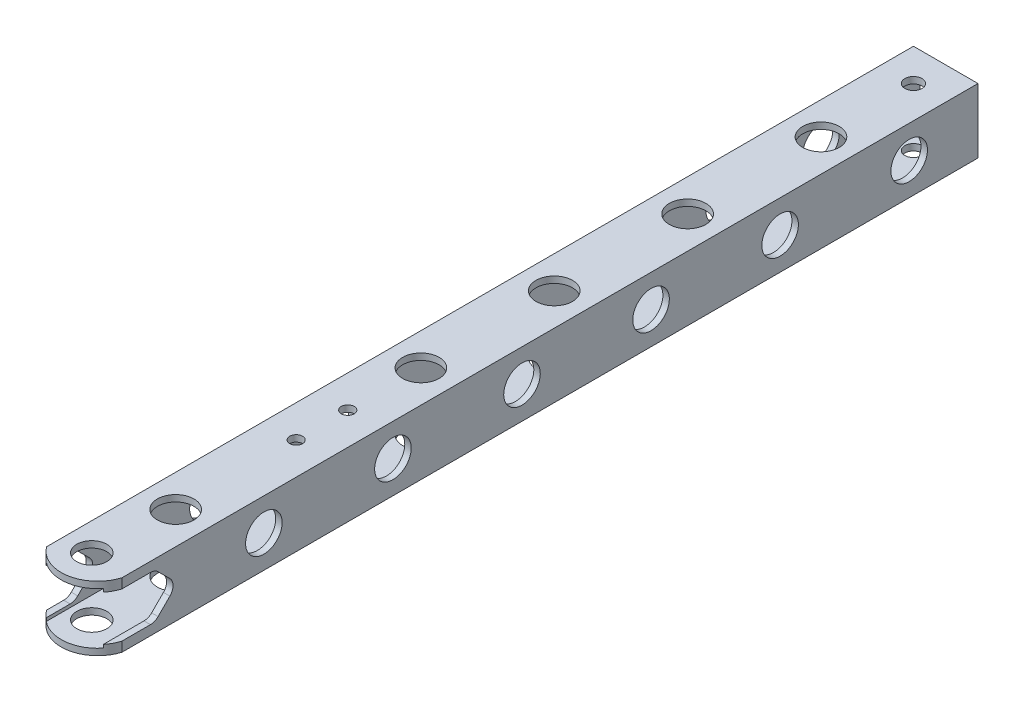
ISO-10303-21;
HEADER;
FILE_DESCRIPTION(('STEP AP214'),'2;1');
FILE_NAME('part.step','',(''),(''),'','','');
FILE_SCHEMA(('AUTOMOTIVE_DESIGN { 1 0 10303 214 1 1 1 1 }'));
ENDSEC;
DATA;
#1=APPLICATION_CONTEXT('core data for automotive mechanical design processes');
#2=APPLICATION_PROTOCOL_DEFINITION('international standard','automotive_design',2000,#1);
#3=PRODUCT_CONTEXT('',#1,'mechanical');
#4=PRODUCT('Part','Part','',(#3));
#5=PRODUCT_RELATED_PRODUCT_CATEGORY('part','',(#4));
#6=PRODUCT_DEFINITION_FORMATION('','',#4);
#7=PRODUCT_DEFINITION_CONTEXT('part definition',#1,'design');
#8=PRODUCT_DEFINITION('design','',#6,#7);
#9=PRODUCT_DEFINITION_SHAPE('','',#8);
#10=(LENGTH_UNIT() NAMED_UNIT(*) SI_UNIT(.MILLI.,.METRE.));
#11=(NAMED_UNIT(*) PLANE_ANGLE_UNIT() SI_UNIT($,.RADIAN.));
#12=(NAMED_UNIT(*) SI_UNIT($,.STERADIAN.) SOLID_ANGLE_UNIT());
#13=UNCERTAINTY_MEASURE_WITH_UNIT(LENGTH_MEASURE(1.E-05),#10,'distance_accuracy_value','');
#14=(GEOMETRIC_REPRESENTATION_CONTEXT(3) GLOBAL_UNCERTAINTY_ASSIGNED_CONTEXT((#13)) GLOBAL_UNIT_ASSIGNED_CONTEXT((#10,
#11,#12)) REPRESENTATION_CONTEXT('',''));
#15=CARTESIAN_POINT('',(0.,0.,0.));
#16=DIRECTION('',(0.,0.,1.));
#17=DIRECTION('',(1.,0.,0.));
#18=AXIS2_PLACEMENT_3D('',#15,#16,#17);
#19=CARTESIAN_POINT('',(-1.25056054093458,-15.,377.996636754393));
#20=DIRECTION('',(0.,1.,0.));
#21=DIRECTION('',(-1.,0.,0.));
#22=AXIS2_PLACEMENT_3D('',#19,#20,#21);
#23=CYLINDRICAL_SURFACE('',#22,17.0033632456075);
#24=DIRECTION('',(0.,1.,0.));
#25=VECTOR('',#24,1.);
#26=CARTESIAN_POINT('',(15.,-15.,383.));
#27=LINE('',#26,#25);
#28=CARTESIAN_POINT('',(15.,-15.,383.));
#29=VERTEX_POINT('',#28);
#30=CARTESIAN_POINT('',(15.,-10.5,383.));
#31=VERTEX_POINT('',#30);
#32=EDGE_CURVE('E233',#29,#31,#27,.T.);
#33=ORIENTED_EDGE('',*,*,#32,.T.);
#34=CARTESIAN_POINT('',(-1.25056054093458,-10.5,377.996636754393));
#35=DIRECTION('',(0.,-1.,0.));
#36=DIRECTION('',(1.,0.,0.));
#37=AXIS2_PLACEMENT_3D('',#34,#35,#36);
#38=CIRCLE('',#37,17.0033632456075);
#39=CARTESIAN_POINT('',(12.,-10.5,388.652011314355));
#40=VERTEX_POINT('',#39);
#41=EDGE_CURVE('E223',#40,#31,#38,.F.);
#42=ORIENTED_EDGE('',*,*,#41,.F.);
#43=DIRECTION('',(0.,1.,0.));
#44=VECTOR('',#43,1.);
#45=CARTESIAN_POINT('',(12.,-15.,388.652011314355));
#46=LINE('',#45,#44);
#47=CARTESIAN_POINT('',(12.,-12.,388.652011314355));
#48=VERTEX_POINT('',#47);
#49=EDGE_CURVE('E229',#40,#48,#46,.F.);
#50=ORIENTED_EDGE('',*,*,#49,.T.);
#51=CARTESIAN_POINT('',(-1.25056054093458,-12.,377.996636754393));
#52=DIRECTION('',(0.,1.,0.));
#53=DIRECTION('',(-1.,0.,0.));
#54=AXIS2_PLACEMENT_3D('',#51,#52,#53);
#55=CIRCLE('',#54,17.0033632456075);
#56=CARTESIAN_POINT('',(-12.,-12.,391.171002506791));
#57=VERTEX_POINT('',#56);
#58=EDGE_CURVE('E228',#48,#57,#55,.F.);
#59=ORIENTED_EDGE('',*,*,#58,.T.);
#60=DIRECTION('',(0.,1.,0.));
#61=VECTOR('',#60,1.);
#62=CARTESIAN_POINT('',(-12.,-15.,391.171002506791));
#63=LINE('',#62,#61);
#64=CARTESIAN_POINT('',(-12.,-10.5,391.171002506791));
#65=VERTEX_POINT('',#64);
#66=EDGE_CURVE('E238',#57,#65,#63,.T.);
#67=ORIENTED_EDGE('',*,*,#66,.T.);
#68=CARTESIAN_POINT('',(-1.25056054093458,-10.5,377.996636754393));
#69=DIRECTION('',(0.,-1.,0.));
#70=DIRECTION('',(0.,0.,-1.));
#71=AXIS2_PLACEMENT_3D('',#68,#69,#70);
#72=CIRCLE('',#71,17.0033632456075);
#73=CARTESIAN_POINT('',(-15.,-10.5,388.));
#74=VERTEX_POINT('',#73);
#75=EDGE_CURVE('E450',#65,#74,#72,.T.);
#76=ORIENTED_EDGE('',*,*,#75,.T.);
#77=DIRECTION('',(0.,1.,0.));
#78=VECTOR('',#77,1.);
#79=CARTESIAN_POINT('',(-15.,-15.,388.));
#80=LINE('',#79,#78);
#81=CARTESIAN_POINT('',(-15.,-15.,388.));
#82=VERTEX_POINT('',#81);
#83=EDGE_CURVE('E235',#82,#74,#80,.T.);
#84=ORIENTED_EDGE('',*,*,#83,.F.);
#85=CARTESIAN_POINT('',(-1.25056054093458,-15.,377.996636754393));
#86=DIRECTION('',(0.,-1.,0.));
#87=DIRECTION('',(1.,0.,0.));
#88=AXIS2_PLACEMENT_3D('',#85,#86,#87);
#89=CIRCLE('',#88,17.0033632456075);
#90=EDGE_CURVE('E546',#29,#82,#89,.T.);
#91=ORIENTED_EDGE('',*,*,#90,.F.);
#92=EDGE_LOOP('',(#33,#42,#50,#59,#67,#76,#84,#91));
#93=FACE_BOUND('',#92,.T.);
#94=ADVANCED_FACE('F37',(#93),#23,.T.);
#95=CARTESIAN_POINT('',(-15.,15.,395.));
#96=DIRECTION('',(1.,0.,0.));
#97=DIRECTION('',(0.,1.,0.));
#98=AXIS2_PLACEMENT_3D('',#95,#96,#97);
#99=PLANE('',#98);
#100=CARTESIAN_POINT('',(-15.,0.,136.));
#101=DIRECTION('',(-1.,0.,0.));
#102=DIRECTION('',(0.,-1.,0.));
#103=AXIS2_PLACEMENT_3D('',#100,#101,#102);
#104=CIRCLE('',#103,8.50000000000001);
#105=CARTESIAN_POINT('',(-15.,-8.50000000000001,136.));
#106=VERTEX_POINT('',#105);
#107=EDGE_CURVE('E274',#106,#106,#104,.T.);
#108=ORIENTED_EDGE('',*,*,#107,.F.);
#109=EDGE_LOOP('',(#108));
#110=FACE_BOUND('',#109,.T.);
#111=CARTESIAN_POINT('',(-15.,0.,76.));
#112=DIRECTION('',(-1.,0.,0.));
#113=DIRECTION('',(0.,-1.,0.));
#114=AXIS2_PLACEMENT_3D('',#111,#112,#113);
#115=CIRCLE('',#114,8.50000000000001);
#116=CARTESIAN_POINT('',(-15.,-8.50000000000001,76.));
#117=VERTEX_POINT('',#116);
#118=EDGE_CURVE('E280',#117,#117,#115,.T.);
#119=ORIENTED_EDGE('',*,*,#118,.F.);
#120=EDGE_LOOP('',(#119));
#121=FACE_BOUND('',#120,.T.);
#122=CARTESIAN_POINT('',(-15.,0.,31.));
#123=DIRECTION('',(-1.,0.,0.));
#124=DIRECTION('',(0.,-1.,0.));
#125=AXIS2_PLACEMENT_3D('',#122,#123,#124);
#126=CIRCLE('',#125,8.50000000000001);
#127=CARTESIAN_POINT('',(-15.,-8.50000000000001,31.));
#128=VERTEX_POINT('',#127);
#129=EDGE_CURVE('E286',#128,#128,#126,.T.);
#130=ORIENTED_EDGE('',*,*,#129,.F.);
#131=EDGE_LOOP('',(#130));
#132=FACE_BOUND('',#131,.T.);
#133=DIRECTION('',(0.,-0.707106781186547,-0.707106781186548));
#134=VECTOR('',#133,1.);
#135=CARTESIAN_POINT('',(-15.,10.5,378.));
#136=LINE('',#135,#134);
#137=CARTESIAN_POINT('',(-15.,9.03553390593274,376.535533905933));
#138=VERTEX_POINT('',#137);
#139=CARTESIAN_POINT('',(-15.,3.53553390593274,371.035533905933));
#140=VERTEX_POINT('',#139);
#141=EDGE_CURVE('E528',#138,#140,#136,.T.);
#142=ORIENTED_EDGE('',*,*,#141,.F.);
#143=CARTESIAN_POINT('',(-15.,5.49999999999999,380.071067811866));
#144=DIRECTION('',(1.,0.,0.));
#145=DIRECTION('',(0.,1.,0.));
#146=AXIS2_PLACEMENT_3D('',#143,#144,#145);
#147=CIRCLE('',#146,5.);
#148=CARTESIAN_POINT('',(-15.,10.5,380.071067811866));
#149=VERTEX_POINT('',#148);
#150=EDGE_CURVE('E46',#138,#149,#147,.T.);
#151=ORIENTED_EDGE('',*,*,#150,.T.);
#152=DIRECTION('',(0.,0.,-1.));
#153=VECTOR('',#152,1.);
#154=CARTESIAN_POINT('',(-15.,10.5,391.171002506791));
#155=LINE('',#154,#153);
#156=CARTESIAN_POINT('',(-15.,10.5,388.));
#157=VERTEX_POINT('',#156);
#158=EDGE_CURVE('E533',#157,#149,#155,.T.);
#159=ORIENTED_EDGE('',*,*,#158,.F.);
#160=CARTESIAN_POINT('',(-15.,15.,388.));
#161=VERTEX_POINT('',#160);
#162=EDGE_CURVE('E549',#157,#161,#80,.T.);
#163=ORIENTED_EDGE('',*,*,#162,.T.);
#164=DIRECTION('',(0.,0.,-1.));
#165=VECTOR('',#164,1.);
#166=CARTESIAN_POINT('',(-15.,15.,395.));
#167=LINE('',#166,#165);
#168=CARTESIAN_POINT('',(-15.,15.,-15.));
#169=VERTEX_POINT('',#168);
#170=EDGE_CURVE('E365',#161,#169,#167,.T.);
#171=ORIENTED_EDGE('',*,*,#170,.T.);
#172=DIRECTION('',(0.,-1.,0.));
#173=VECTOR('',#172,1.);
#174=CARTESIAN_POINT('',(-15.,15.,-15.));
#175=LINE('',#174,#173);
#176=CARTESIAN_POINT('',(-15.,-15.,-15.));
#177=VERTEX_POINT('',#176);
#178=EDGE_CURVE('E345',#169,#177,#175,.T.);
#179=ORIENTED_EDGE('',*,*,#178,.T.);
#180=DIRECTION('',(0.,0.,-1.));
#181=VECTOR('',#180,1.);
#182=CARTESIAN_POINT('',(-15.,-15.,395.));
#183=LINE('',#182,#181);
#184=EDGE_CURVE('E371',#82,#177,#183,.T.);
#185=ORIENTED_EDGE('',*,*,#184,.F.);
#186=ORIENTED_EDGE('',*,*,#83,.T.);
#187=DIRECTION('',(0.,0.,1.));
#188=VECTOR('',#187,1.);
#189=CARTESIAN_POINT('',(-15.,-10.5,378.));
#190=LINE('',#189,#188);
#191=CARTESIAN_POINT('',(-15.,-10.5,380.071067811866));
#192=VERTEX_POINT('',#191);
#193=EDGE_CURVE('E535',#192,#74,#190,.T.);
#194=ORIENTED_EDGE('',*,*,#193,.F.);
#195=CARTESIAN_POINT('',(-15.,-5.5,380.071067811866));
#196=DIRECTION('',(1.,0.,0.));
#197=DIRECTION('',(0.,1.,0.));
#198=AXIS2_PLACEMENT_3D('',#195,#196,#197);
#199=CIRCLE('',#198,5.);
#200=CARTESIAN_POINT('',(-15.,-9.03553390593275,376.535533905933));
#201=VERTEX_POINT('',#200);
#202=EDGE_CURVE('E484',#192,#201,#199,.T.);
#203=ORIENTED_EDGE('',*,*,#202,.T.);
#204=DIRECTION('',(0.,-0.707106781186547,0.707106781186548));
#205=VECTOR('',#204,1.);
#206=CARTESIAN_POINT('',(-15.,0.,367.5));
#207=LINE('',#206,#205);
#208=CARTESIAN_POINT('',(-15.,-3.53553390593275,371.035533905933));
#209=VERTEX_POINT('',#208);
#210=EDGE_CURVE('E529',#209,#201,#207,.T.);
#211=ORIENTED_EDGE('',*,*,#210,.F.);
#212=CARTESIAN_POINT('',(-15.,0.,374.571067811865));
#213=DIRECTION('',(1.,0.,0.));
#214=DIRECTION('',(0.,1.,0.));
#215=AXIS2_PLACEMENT_3D('',#212,#213,#214);
#216=CIRCLE('',#215,5.);
#217=EDGE_CURVE('E499',#209,#140,#216,.T.);
#218=ORIENTED_EDGE('',*,*,#217,.T.);
#219=EDGE_LOOP('',(#142,#151,#159,#163,#171,#179,#185,#186,#194,#203,#211,#218));
#220=FACE_BOUND('',#219,.T.);
#221=CARTESIAN_POINT('',(-15.,0.,196.));
#222=DIRECTION('',(-1.,0.,0.));
#223=DIRECTION('',(0.,-1.,0.));
#224=AXIS2_PLACEMENT_3D('',#221,#222,#223);
#225=CIRCLE('',#224,8.50000000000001);
#226=CARTESIAN_POINT('',(-15.,-8.50000000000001,196.));
#227=VERTEX_POINT('',#226);
#228=EDGE_CURVE('E428',#227,#227,#225,.T.);
#229=ORIENTED_EDGE('',*,*,#228,.F.);
#230=EDGE_LOOP('',(#229));
#231=FACE_BOUND('',#230,.T.);
#232=CARTESIAN_POINT('',(-15.,0.,256.));
#233=DIRECTION('',(-1.,0.,0.));
#234=DIRECTION('',(0.,-1.,0.));
#235=AXIS2_PLACEMENT_3D('',#232,#233,#234);
#236=CIRCLE('',#235,8.50000000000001);
#237=CARTESIAN_POINT('',(-15.,-8.50000000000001,256.));
#238=VERTEX_POINT('',#237);
#239=EDGE_CURVE('E434',#238,#238,#236,.T.);
#240=ORIENTED_EDGE('',*,*,#239,.F.);
#241=EDGE_LOOP('',(#240));
#242=FACE_BOUND('',#241,.T.);
#243=CARTESIAN_POINT('',(-15.,0.,316.));
#244=DIRECTION('',(-1.,0.,0.));
#245=DIRECTION('',(0.,-1.,0.));
#246=AXIS2_PLACEMENT_3D('',#243,#244,#245);
#247=CIRCLE('',#246,8.50000000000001);
#248=CARTESIAN_POINT('',(-15.,-8.50000000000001,316.));
#249=VERTEX_POINT('',#248);
#250=EDGE_CURVE('E440',#249,#249,#247,.T.);
#251=ORIENTED_EDGE('',*,*,#250,.F.);
#252=EDGE_LOOP('',(#251));
#253=FACE_BOUND('',#252,.T.);
#254=ADVANCED_FACE('F526',(#110,#121,#132,#220,#231,#242,#253),#99,.F.);
#255=CARTESIAN_POINT('',(-15.,-15.,395.));
#256=DIRECTION('',(0.,1.,0.));
#257=DIRECTION('',(-1.,0.,0.));
#258=AXIS2_PLACEMENT_3D('',#255,#256,#257);
#259=PLANE('',#258);
#260=CARTESIAN_POINT('',(0.,-15.,0.));
#261=DIRECTION('',(0.,1.,0.));
#262=DIRECTION('',(-1.,0.,0.));
#263=AXIS2_PLACEMENT_3D('',#260,#261,#262);
#264=CIRCLE('',#263,4.);
#265=CARTESIAN_POINT('',(-4.,-15.,0.));
#266=VERTEX_POINT('',#265);
#267=EDGE_CURVE('E1191',#266,#266,#264,.T.);
#268=ORIENTED_EDGE('',*,*,#267,.T.);
#269=EDGE_LOOP('',(#268));
#270=FACE_BOUND('',#269,.T.);
#271=CARTESIAN_POINT('',(-2.,-15.,380.));
#272=DIRECTION('',(0.,1.,0.));
#273=DIRECTION('',(-1.,0.,0.));
#274=AXIS2_PLACEMENT_3D('',#271,#272,#273);
#275=CIRCLE('',#274,7.);
#276=CARTESIAN_POINT('',(-9.,-15.,380.));
#277=VERTEX_POINT('',#276);
#278=EDGE_CURVE('E242',#277,#277,#275,.T.);
#279=ORIENTED_EDGE('',*,*,#278,.T.);
#280=EDGE_LOOP('',(#279));
#281=FACE_BOUND('',#280,.T.);
#282=CARTESIAN_POINT('',(-1.41148666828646E-13,-15.,263.));
#283=DIRECTION('',(0.,1.,0.));
#284=DIRECTION('',(0.,0.,1.));
#285=AXIS2_PLACEMENT_3D('',#282,#283,#284);
#286=CIRCLE('',#285,2.99999999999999);
#287=CARTESIAN_POINT('',(-1.41148666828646E-13,-15.,266.));
#288=VERTEX_POINT('',#287);
#289=EDGE_CURVE('E251',#288,#288,#286,.T.);
#290=ORIENTED_EDGE('',*,*,#289,.T.);
#291=EDGE_LOOP('',(#290));
#292=FACE_BOUND('',#291,.T.);
#293=CARTESIAN_POINT('',(-1.41148666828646E-13,-15.,287.));
#294=DIRECTION('',(0.,1.,0.));
#295=DIRECTION('',(0.,0.,1.));
#296=AXIS2_PLACEMENT_3D('',#293,#294,#295);
#297=CIRCLE('',#296,2.99999999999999);
#298=CARTESIAN_POINT('',(-1.41148666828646E-13,-15.,290.));
#299=VERTEX_POINT('',#298);
#300=EDGE_CURVE('E261',#299,#299,#297,.T.);
#301=ORIENTED_EDGE('',*,*,#300,.T.);
#302=EDGE_LOOP('',(#301));
#303=FACE_BOUND('',#302,.T.);
#304=CARTESIAN_POINT('',(-1.35308431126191E-13,-15.,343.));
#305=DIRECTION('',(0.,1.,0.));
#306=DIRECTION('',(-1.,0.,0.));
#307=AXIS2_PLACEMENT_3D('',#304,#305,#306);
#308=CIRCLE('',#307,8.50000000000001);
#309=CARTESIAN_POINT('',(-8.50000000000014,-15.,343.));
#310=VERTEX_POINT('',#309);
#311=EDGE_CURVE('E304',#310,#310,#308,.T.);
#312=ORIENTED_EDGE('',*,*,#311,.T.);
#313=EDGE_LOOP('',(#312));
#314=FACE_BOUND('',#313,.T.);
#315=CARTESIAN_POINT('',(-1.35308431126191E-13,-15.,105.));
#316=DIRECTION('',(0.,1.,0.));
#317=DIRECTION('',(-1.,0.,0.));
#318=AXIS2_PLACEMENT_3D('',#315,#316,#317);
#319=CIRCLE('',#318,8.5);
#320=CARTESIAN_POINT('',(-8.50000000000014,-15.,105.));
#321=VERTEX_POINT('',#320);
#322=EDGE_CURVE('E320',#321,#321,#319,.T.);
#323=ORIENTED_EDGE('',*,*,#322,.T.);
#324=EDGE_LOOP('',(#323));
#325=FACE_BOUND('',#324,.T.);
#326=CARTESIAN_POINT('',(-1.35308431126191E-13,-15.,43.));
#327=DIRECTION('',(0.,1.,0.));
#328=DIRECTION('',(-1.,0.,0.));
#329=AXIS2_PLACEMENT_3D('',#326,#327,#328);
#330=CIRCLE('',#329,8.5);
#331=CARTESIAN_POINT('',(-8.50000000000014,-15.,43.));
#332=VERTEX_POINT('',#331);
#333=EDGE_CURVE('E326',#332,#332,#330,.T.);
#334=ORIENTED_EDGE('',*,*,#333,.T.);
#335=EDGE_LOOP('',(#334));
#336=FACE_BOUND('',#335,.T.);
#337=DIRECTION('',(0.,0.,-1.));
#338=VECTOR('',#337,1.);
#339=CARTESIAN_POINT('',(15.,-15.,395.));
#340=LINE('',#339,#338);
#341=CARTESIAN_POINT('',(15.,-15.,-15.));
#342=VERTEX_POINT('',#341);
#343=EDGE_CURVE('E369',#29,#342,#340,.T.);
#344=ORIENTED_EDGE('',*,*,#343,.F.);
#345=ORIENTED_EDGE('',*,*,#90,.T.);
#346=ORIENTED_EDGE('',*,*,#184,.T.);
#347=DIRECTION('',(1.,0.,0.));
#348=VECTOR('',#347,1.);
#349=CARTESIAN_POINT('',(-15.,-15.,-15.));
#350=LINE('',#349,#348);
#351=EDGE_CURVE('E348',#177,#342,#350,.T.);
#352=ORIENTED_EDGE('',*,*,#351,.T.);
#353=EDGE_LOOP('',(#344,#345,#346,#352));
#354=FACE_BOUND('',#353,.T.);
#355=CARTESIAN_POINT('',(-1.35308431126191E-13,-15.,167.));
#356=DIRECTION('',(0.,1.,0.));
#357=DIRECTION('',(-1.,0.,0.));
#358=AXIS2_PLACEMENT_3D('',#355,#356,#357);
#359=CIRCLE('',#358,8.5);
#360=CARTESIAN_POINT('',(-8.50000000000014,-15.,167.));
#361=VERTEX_POINT('',#360);
#362=EDGE_CURVE('E378',#361,#361,#359,.T.);
#363=ORIENTED_EDGE('',*,*,#362,.T.);
#364=EDGE_LOOP('',(#363));
#365=FACE_BOUND('',#364,.T.);
#366=CARTESIAN_POINT('',(-1.35308431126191E-13,-15.,229.));
#367=DIRECTION('',(0.,1.,0.));
#368=DIRECTION('',(-1.,0.,0.));
#369=AXIS2_PLACEMENT_3D('',#366,#367,#368);
#370=CIRCLE('',#369,8.5);
#371=CARTESIAN_POINT('',(-8.50000000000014,-15.,229.));
#372=VERTEX_POINT('',#371);
#373=EDGE_CURVE('E384',#372,#372,#370,.T.);
#374=ORIENTED_EDGE('',*,*,#373,.T.);
#375=EDGE_LOOP('',(#374));
#376=FACE_BOUND('',#375,.T.);
#377=ADVANCED_FACE('F574',(#270,#281,#292,#303,#314,#325,#336,#354,#365,#376),#259,.F.);
#378=CARTESIAN_POINT('',(15.,15.,395.));
#379=DIRECTION('',(-1.,0.,0.));
#380=DIRECTION('',(0.,-1.,0.));
#381=AXIS2_PLACEMENT_3D('',#378,#379,#380);
#382=PLANE('',#381);
#383=CARTESIAN_POINT('',(15.,0.,77.));
#384=DIRECTION('',(1.,0.,0.));
#385=DIRECTION('',(0.,1.,0.));
#386=AXIS2_PLACEMENT_3D('',#383,#384,#385);
#387=CIRCLE('',#386,8.5);
#388=CARTESIAN_POINT('',(15.,8.50000000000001,77.));
#389=VERTEX_POINT('',#388);
#390=EDGE_CURVE('E292',#389,#389,#387,.T.);
#391=ORIENTED_EDGE('',*,*,#390,.F.);
#392=EDGE_LOOP('',(#391));
#393=FACE_BOUND('',#392,.T.);
#394=CARTESIAN_POINT('',(15.,0.,17.));
#395=DIRECTION('',(1.,0.,0.));
#396=DIRECTION('',(0.,1.,0.));
#397=AXIS2_PLACEMENT_3D('',#394,#395,#396);
#398=CIRCLE('',#397,8.5);
#399=CARTESIAN_POINT('',(15.,8.50000000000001,17.));
#400=VERTEX_POINT('',#399);
#401=EDGE_CURVE('E296',#400,#400,#398,.T.);
#402=ORIENTED_EDGE('',*,*,#401,.F.);
#403=EDGE_LOOP('',(#402));
#404=FACE_BOUND('',#403,.T.);
#405=DIRECTION('',(0.,0.707106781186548,-0.707106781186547));
#406=VECTOR('',#405,1.);
#407=CARTESIAN_POINT('',(15.,-10.5,367.652011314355));
#408=LINE('',#407,#406);
#409=CARTESIAN_POINT('',(15.,-9.03553390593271,366.187545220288));
#410=VERTEX_POINT('',#409);
#411=CARTESIAN_POINT('',(15.,-3.53553390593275,360.687545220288));
#412=VERTEX_POINT('',#411);
#413=EDGE_CURVE('E584',#410,#412,#408,.T.);
#414=ORIENTED_EDGE('',*,*,#413,.F.);
#415=CARTESIAN_POINT('',(15.,-5.49999999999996,369.723079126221));
#416=DIRECTION('',(-1.,0.,0.));
#417=DIRECTION('',(0.,-1.,0.));
#418=AXIS2_PLACEMENT_3D('',#415,#416,#417);
#419=CIRCLE('',#418,5.);
#420=CARTESIAN_POINT('',(15.,-10.5,369.723079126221));
#421=VERTEX_POINT('',#420);
#422=EDGE_CURVE('E488',#410,#421,#419,.T.);
#423=ORIENTED_EDGE('',*,*,#422,.T.);
#424=DIRECTION('',(0.,0.,-1.));
#425=VECTOR('',#424,1.);
#426=CARTESIAN_POINT('',(15.,-10.5,388.652011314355));
#427=LINE('',#426,#425);
#428=EDGE_CURVE('E212',#31,#421,#427,.T.);
#429=ORIENTED_EDGE('',*,*,#428,.F.);
#430=ORIENTED_EDGE('',*,*,#32,.F.);
#431=ORIENTED_EDGE('',*,*,#343,.T.);
#432=DIRECTION('',(0.,1.,0.));
#433=VECTOR('',#432,1.);
#434=CARTESIAN_POINT('',(15.,15.,-15.));
#435=LINE('',#434,#433);
#436=CARTESIAN_POINT('',(15.,15.,-15.));
#437=VERTEX_POINT('',#436);
#438=EDGE_CURVE('E351',#342,#437,#435,.T.);
#439=ORIENTED_EDGE('',*,*,#438,.T.);
#440=DIRECTION('',(0.,0.,-1.));
#441=VECTOR('',#440,1.);
#442=CARTESIAN_POINT('',(15.,15.,395.));
#443=LINE('',#442,#441);
#444=CARTESIAN_POINT('',(15.,15.,383.));
#445=VERTEX_POINT('',#444);
#446=EDGE_CURVE('E367',#445,#437,#443,.T.);
#447=ORIENTED_EDGE('',*,*,#446,.F.);
#448=CARTESIAN_POINT('',(15.,10.5,383.));
#449=VERTEX_POINT('',#448);
#450=EDGE_CURVE('E552',#449,#445,#27,.T.);
#451=ORIENTED_EDGE('',*,*,#450,.F.);
#452=DIRECTION('',(0.,0.,1.));
#453=VECTOR('',#452,1.);
#454=CARTESIAN_POINT('',(15.,10.5,367.652011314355));
#455=LINE('',#454,#453);
#456=CARTESIAN_POINT('',(15.,10.5,369.723079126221));
#457=VERTEX_POINT('',#456);
#458=EDGE_CURVE('E219',#457,#449,#455,.T.);
#459=ORIENTED_EDGE('',*,*,#458,.F.);
#460=CARTESIAN_POINT('',(15.,5.49999999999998,369.723079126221));
#461=DIRECTION('',(-1.,0.,0.));
#462=DIRECTION('',(0.,-1.,0.));
#463=AXIS2_PLACEMENT_3D('',#460,#461,#462);
#464=CIRCLE('',#463,5.);
#465=CARTESIAN_POINT('',(15.,9.03553390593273,366.187545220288));
#466=VERTEX_POINT('',#465);
#467=EDGE_CURVE('E492',#457,#466,#464,.T.);
#468=ORIENTED_EDGE('',*,*,#467,.T.);
#469=DIRECTION('',(0.,0.707106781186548,0.707106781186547));
#470=VECTOR('',#469,1.);
#471=CARTESIAN_POINT('',(15.,0.,357.152011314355));
#472=LINE('',#471,#470);
#473=CARTESIAN_POINT('',(15.,3.53553390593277,360.687545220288));
#474=VERTEX_POINT('',#473);
#475=EDGE_CURVE('E587',#474,#466,#472,.T.);
#476=ORIENTED_EDGE('',*,*,#475,.F.);
#477=CARTESIAN_POINT('',(15.,0.,364.223079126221));
#478=DIRECTION('',(-1.,0.,0.));
#479=DIRECTION('',(0.,-1.,0.));
#480=AXIS2_PLACEMENT_3D('',#477,#478,#479);
#481=CIRCLE('',#480,5.);
#482=EDGE_CURVE('E495',#474,#412,#481,.T.);
#483=ORIENTED_EDGE('',*,*,#482,.T.);
#484=EDGE_LOOP('',(#414,#423,#429,#430,#431,#439,#447,#451,#459,#468,#476,#483));
#485=FACE_BOUND('',#484,.T.);
#486=CARTESIAN_POINT('',(15.,0.,137.));
#487=DIRECTION('',(1.,0.,0.));
#488=DIRECTION('',(0.,1.,0.));
#489=AXIS2_PLACEMENT_3D('',#486,#487,#488);
#490=CIRCLE('',#489,8.5);
#491=CARTESIAN_POINT('',(15.,8.50000000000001,137.));
#492=VERTEX_POINT('',#491);
#493=EDGE_CURVE('E404',#492,#492,#490,.T.);
#494=ORIENTED_EDGE('',*,*,#493,.F.);
#495=EDGE_LOOP('',(#494));
#496=FACE_BOUND('',#495,.T.);
#497=CARTESIAN_POINT('',(15.,0.,197.));
#498=DIRECTION('',(1.,0.,0.));
#499=DIRECTION('',(0.,1.,0.));
#500=AXIS2_PLACEMENT_3D('',#497,#498,#499);
#501=CIRCLE('',#500,8.5);
#502=CARTESIAN_POINT('',(15.,8.50000000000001,197.));
#503=VERTEX_POINT('',#502);
#504=EDGE_CURVE('E410',#503,#503,#501,.T.);
#505=ORIENTED_EDGE('',*,*,#504,.F.);
#506=EDGE_LOOP('',(#505));
#507=FACE_BOUND('',#506,.T.);
#508=CARTESIAN_POINT('',(15.,0.,257.));
#509=DIRECTION('',(1.,0.,0.));
#510=DIRECTION('',(0.,1.,0.));
#511=AXIS2_PLACEMENT_3D('',#508,#509,#510);
#512=CIRCLE('',#511,8.5);
#513=CARTESIAN_POINT('',(15.,8.50000000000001,257.));
#514=VERTEX_POINT('',#513);
#515=EDGE_CURVE('E416',#514,#514,#512,.T.);
#516=ORIENTED_EDGE('',*,*,#515,.F.);
#517=EDGE_LOOP('',(#516));
#518=FACE_BOUND('',#517,.T.);
#519=CARTESIAN_POINT('',(15.,0.,317.));
#520=DIRECTION('',(1.,0.,0.));
#521=DIRECTION('',(0.,1.,0.));
#522=AXIS2_PLACEMENT_3D('',#519,#520,#521);
#523=CIRCLE('',#522,8.5);
#524=CARTESIAN_POINT('',(15.,8.50000000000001,317.));
#525=VERTEX_POINT('',#524);
#526=EDGE_CURVE('E422',#525,#525,#523,.T.);
#527=ORIENTED_EDGE('',*,*,#526,.F.);
#528=EDGE_LOOP('',(#527));
#529=FACE_BOUND('',#528,.T.);
#530=ADVANCED_FACE('F579',(#393,#404,#485,#496,#507,#518,#529),#382,.F.);
#531=CARTESIAN_POINT('',(-15.,15.,395.));
#532=DIRECTION('',(0.,-1.,0.));
#533=DIRECTION('',(1.,0.,0.));
#534=AXIS2_PLACEMENT_3D('',#531,#532,#533);
#535=PLANE('',#534);
#536=CARTESIAN_POINT('',(0.,15.,0.));
#537=DIRECTION('',(0.,1.,0.));
#538=DIRECTION('',(-1.,0.,0.));
#539=AXIS2_PLACEMENT_3D('',#536,#537,#538);
#540=CIRCLE('',#539,4.);
#541=CARTESIAN_POINT('',(-4.,15.,0.));
#542=VERTEX_POINT('',#541);
#543=EDGE_CURVE('E1190',#542,#542,#540,.T.);
#544=ORIENTED_EDGE('',*,*,#543,.F.);
#545=EDGE_LOOP('',(#544));
#546=FACE_BOUND('',#545,.T.);
#547=CARTESIAN_POINT('',(-2.,15.,380.));
#548=DIRECTION('',(0.,1.,0.));
#549=DIRECTION('',(-1.,0.,0.));
#550=AXIS2_PLACEMENT_3D('',#547,#548,#549);
#551=CIRCLE('',#550,7.);
#552=CARTESIAN_POINT('',(-9.00000000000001,15.,380.));
#553=VERTEX_POINT('',#552);
#554=EDGE_CURVE('E241',#553,#553,#551,.T.);
#555=ORIENTED_EDGE('',*,*,#554,.F.);
#556=EDGE_LOOP('',(#555));
#557=FACE_BOUND('',#556,.T.);
#558=CARTESIAN_POINT('',(-1.41148666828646E-13,15.,263.));
#559=DIRECTION('',(0.,1.,0.));
#560=DIRECTION('',(0.,0.,1.));
#561=AXIS2_PLACEMENT_3D('',#558,#559,#560);
#562=CIRCLE('',#561,3.);
#563=CARTESIAN_POINT('',(-1.41148666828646E-13,15.,266.));
#564=VERTEX_POINT('',#563);
#565=EDGE_CURVE('E254',#564,#564,#562,.T.);
#566=ORIENTED_EDGE('',*,*,#565,.F.);
#567=EDGE_LOOP('',(#566));
#568=FACE_BOUND('',#567,.T.);
#569=CARTESIAN_POINT('',(-1.41148666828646E-13,15.,287.));
#570=DIRECTION('',(0.,1.,0.));
#571=DIRECTION('',(0.,0.,1.));
#572=AXIS2_PLACEMENT_3D('',#569,#570,#571);
#573=CIRCLE('',#572,3.);
#574=CARTESIAN_POINT('',(-1.41148666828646E-13,15.,290.));
#575=VERTEX_POINT('',#574);
#576=EDGE_CURVE('E264',#575,#575,#573,.T.);
#577=ORIENTED_EDGE('',*,*,#576,.F.);
#578=EDGE_LOOP('',(#577));
#579=FACE_BOUND('',#578,.T.);
#580=CARTESIAN_POINT('',(-1.42247325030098E-13,15.,343.));
#581=DIRECTION('',(0.,1.,0.));
#582=DIRECTION('',(-1.,0.,0.));
#583=AXIS2_PLACEMENT_3D('',#580,#581,#582);
#584=CIRCLE('',#583,8.50000000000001);
#585=CARTESIAN_POINT('',(-8.50000000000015,15.,343.));
#586=VERTEX_POINT('',#585);
#587=EDGE_CURVE('E299',#586,#586,#584,.T.);
#588=ORIENTED_EDGE('',*,*,#587,.F.);
#589=EDGE_LOOP('',(#588));
#590=FACE_BOUND('',#589,.T.);
#591=CARTESIAN_POINT('',(-1.42247325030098E-13,15.,105.));
#592=DIRECTION('',(0.,1.,0.));
#593=DIRECTION('',(-1.,0.,0.));
#594=AXIS2_PLACEMENT_3D('',#591,#592,#593);
#595=CIRCLE('',#594,8.5);
#596=CARTESIAN_POINT('',(-8.50000000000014,15.,105.));
#597=VERTEX_POINT('',#596);
#598=EDGE_CURVE('E314',#597,#597,#595,.T.);
#599=ORIENTED_EDGE('',*,*,#598,.F.);
#600=EDGE_LOOP('',(#599));
#601=FACE_BOUND('',#600,.T.);
#602=CARTESIAN_POINT('',(-1.42247325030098E-13,15.,43.));
#603=DIRECTION('',(0.,1.,0.));
#604=DIRECTION('',(-1.,0.,0.));
#605=AXIS2_PLACEMENT_3D('',#602,#603,#604);
#606=CIRCLE('',#605,8.5);
#607=CARTESIAN_POINT('',(-8.50000000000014,15.,43.));
#608=VERTEX_POINT('',#607);
#609=EDGE_CURVE('E323',#608,#608,#606,.T.);
#610=ORIENTED_EDGE('',*,*,#609,.F.);
#611=EDGE_LOOP('',(#610));
#612=FACE_BOUND('',#611,.T.);
#613=ORIENTED_EDGE('',*,*,#170,.F.);
#614=CARTESIAN_POINT('',(-1.25056054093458,15.,377.996636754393));
#615=DIRECTION('',(0.,-1.,0.));
#616=DIRECTION('',(1.,0.,0.));
#617=AXIS2_PLACEMENT_3D('',#614,#615,#616);
#618=CIRCLE('',#617,17.0033632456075);
#619=EDGE_CURVE('E543',#445,#161,#618,.T.);
#620=ORIENTED_EDGE('',*,*,#619,.F.);
#621=ORIENTED_EDGE('',*,*,#446,.T.);
#622=DIRECTION('',(-1.,0.,0.));
#623=VECTOR('',#622,1.);
#624=CARTESIAN_POINT('',(-15.,15.,-15.));
#625=LINE('',#624,#623);
#626=EDGE_CURVE('E354',#437,#169,#625,.T.);
#627=ORIENTED_EDGE('',*,*,#626,.T.);
#628=EDGE_LOOP('',(#613,#620,#621,#627));
#629=FACE_BOUND('',#628,.T.);
#630=CARTESIAN_POINT('',(-1.42247325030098E-13,15.,167.));
#631=DIRECTION('',(0.,1.,0.));
#632=DIRECTION('',(-1.,0.,0.));
#633=AXIS2_PLACEMENT_3D('',#630,#631,#632);
#634=CIRCLE('',#633,8.5);
#635=CARTESIAN_POINT('',(-8.50000000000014,15.,167.));
#636=VERTEX_POINT('',#635);
#637=EDGE_CURVE('E390',#636,#636,#634,.T.);
#638=ORIENTED_EDGE('',*,*,#637,.F.);
#639=EDGE_LOOP('',(#638));
#640=FACE_BOUND('',#639,.T.);
#641=CARTESIAN_POINT('',(-1.42247325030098E-13,15.,229.));
#642=DIRECTION('',(0.,1.,0.));
#643=DIRECTION('',(-1.,0.,0.));
#644=AXIS2_PLACEMENT_3D('',#641,#642,#643);
#645=CIRCLE('',#644,8.5);
#646=CARTESIAN_POINT('',(-8.50000000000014,15.,229.));
#647=VERTEX_POINT('',#646);
#648=EDGE_CURVE('E396',#647,#647,#645,.T.);
#649=ORIENTED_EDGE('',*,*,#648,.F.);
#650=EDGE_LOOP('',(#649));
#651=FACE_BOUND('',#650,.T.);
#652=ADVANCED_FACE('F565',(#546,#557,#568,#579,#590,#601,#612,#629,#640,#651),#535,.F.);
#653=CARTESIAN_POINT('',(-12.,12.,395.));
#654=DIRECTION('',(1.,0.,0.));
#655=DIRECTION('',(0.,1.,0.));
#656=AXIS2_PLACEMENT_3D('',#653,#654,#655);
#657=PLANE('',#656);
#658=DIRECTION('',(0.,0.,-1.));
#659=VECTOR('',#658,1.);
#660=CARTESIAN_POINT('',(-12.,10.5,391.171002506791));
#661=LINE('',#660,#659);
#662=CARTESIAN_POINT('',(-12.,10.5,391.171002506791));
#663=VERTEX_POINT('',#662);
#664=CARTESIAN_POINT('',(-12.,10.5,380.071067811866));
#665=VERTEX_POINT('',#664);
#666=EDGE_CURVE('E541',#663,#665,#661,.T.);
#667=ORIENTED_EDGE('',*,*,#666,.T.);
#668=CARTESIAN_POINT('',(-12.,5.5,380.071067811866));
#669=DIRECTION('',(1.,0.,0.));
#670=DIRECTION('',(0.,1.,0.));
#671=AXIS2_PLACEMENT_3D('',#668,#669,#670);
#672=CIRCLE('',#671,5.);
#673=CARTESIAN_POINT('',(-12.,9.03553390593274,376.535533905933));
#674=VERTEX_POINT('',#673);
#675=EDGE_CURVE('E11',#665,#674,#672,.F.);
#676=ORIENTED_EDGE('',*,*,#675,.T.);
#677=DIRECTION('',(0.,-0.707106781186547,-0.707106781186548));
#678=VECTOR('',#677,1.);
#679=CARTESIAN_POINT('',(-12.,10.5,378.));
#680=LINE('',#679,#678);
#681=CARTESIAN_POINT('',(-12.,3.53553390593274,371.035533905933));
#682=VERTEX_POINT('',#681);
#683=EDGE_CURVE('E513',#674,#682,#680,.T.);
#684=ORIENTED_EDGE('',*,*,#683,.T.);
#685=CARTESIAN_POINT('',(-12.,0.,374.571067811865));
#686=DIRECTION('',(1.,0.,0.));
#687=DIRECTION('',(0.,1.,0.));
#688=AXIS2_PLACEMENT_3D('',#685,#686,#687);
#689=CIRCLE('',#688,5.);
#690=CARTESIAN_POINT('',(-12.,-3.53553390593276,371.035533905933));
#691=VERTEX_POINT('',#690);
#692=EDGE_CURVE('E501',#682,#691,#689,.F.);
#693=ORIENTED_EDGE('',*,*,#692,.T.);
#694=DIRECTION('',(0.,-0.707106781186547,0.707106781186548));
#695=VECTOR('',#694,1.);
#696=CARTESIAN_POINT('',(-12.,0.,367.5));
#697=LINE('',#696,#695);
#698=CARTESIAN_POINT('',(-12.,-9.03553390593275,376.535533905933));
#699=VERTEX_POINT('',#698);
#700=EDGE_CURVE('E510',#691,#699,#697,.T.);
#701=ORIENTED_EDGE('',*,*,#700,.T.);
#702=CARTESIAN_POINT('',(-12.,-5.5,380.071067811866));
#703=DIRECTION('',(1.,0.,0.));
#704=DIRECTION('',(0.,1.,0.));
#705=AXIS2_PLACEMENT_3D('',#702,#703,#704);
#706=CIRCLE('',#705,5.);
#707=CARTESIAN_POINT('',(-12.,-10.5,380.071067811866));
#708=VERTEX_POINT('',#707);
#709=EDGE_CURVE('E486',#699,#708,#706,.F.);
#710=ORIENTED_EDGE('',*,*,#709,.T.);
#711=DIRECTION('',(0.,0.,1.));
#712=VECTOR('',#711,1.);
#713=CARTESIAN_POINT('',(-12.,-10.5,378.));
#714=LINE('',#713,#712);
#715=EDGE_CURVE('E522',#708,#65,#714,.T.);
#716=ORIENTED_EDGE('',*,*,#715,.T.);
#717=ORIENTED_EDGE('',*,*,#66,.F.);
#718=DIRECTION('',(0.,0.,-1.));
#719=VECTOR('',#718,1.);
#720=CARTESIAN_POINT('',(-12.,-12.,395.));
#721=LINE('',#720,#719);
#722=CARTESIAN_POINT('',(-12.,-12.,-15.));
#723=VERTEX_POINT('',#722);
#724=EDGE_CURVE('E363',#57,#723,#721,.T.);
#725=ORIENTED_EDGE('',*,*,#724,.T.);
#726=DIRECTION('',(0.,-1.,0.));
#727=VECTOR('',#726,1.);
#728=CARTESIAN_POINT('',(-12.,12.,-15.));
#729=LINE('',#728,#727);
#730=CARTESIAN_POINT('',(-12.,12.,-15.));
#731=VERTEX_POINT('',#730);
#732=EDGE_CURVE('E333',#731,#723,#729,.T.);
#733=ORIENTED_EDGE('',*,*,#732,.F.);
#734=DIRECTION('',(0.,0.,-1.));
#735=VECTOR('',#734,1.);
#736=CARTESIAN_POINT('',(-12.,12.,395.));
#737=LINE('',#736,#735);
#738=CARTESIAN_POINT('',(-12.,12.,391.171002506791));
#739=VERTEX_POINT('',#738);
#740=EDGE_CURVE('E357',#739,#731,#737,.T.);
#741=ORIENTED_EDGE('',*,*,#740,.F.);
#742=EDGE_CURVE('E231',#663,#739,#63,.T.);
#743=ORIENTED_EDGE('',*,*,#742,.F.);
#744=EDGE_LOOP('',(#667,#676,#684,#693,#701,#710,#716,#717,#725,#733,#741,#743));
#745=FACE_BOUND('',#744,.T.);
#746=CARTESIAN_POINT('',(-12.,0.,136.));
#747=DIRECTION('',(1.,0.,0.));
#748=DIRECTION('',(0.,1.,0.));
#749=AXIS2_PLACEMENT_3D('',#746,#747,#748);
#750=CIRCLE('',#749,8.50000000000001);
#751=CARTESIAN_POINT('',(-12.,-8.50000000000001,136.));
#752=VERTEX_POINT('',#751);
#753=EDGE_CURVE('E271',#752,#752,#750,.F.);
#754=ORIENTED_EDGE('',*,*,#753,.T.);
#755=EDGE_LOOP('',(#754));
#756=FACE_BOUND('',#755,.T.);
#757=CARTESIAN_POINT('',(-12.,0.,76.));
#758=DIRECTION('',(1.,0.,0.));
#759=DIRECTION('',(0.,1.,0.));
#760=AXIS2_PLACEMENT_3D('',#757,#758,#759);
#761=CIRCLE('',#760,8.50000000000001);
#762=CARTESIAN_POINT('',(-12.,-8.50000000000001,76.));
#763=VERTEX_POINT('',#762);
#764=EDGE_CURVE('E277',#763,#763,#761,.F.);
#765=ORIENTED_EDGE('',*,*,#764,.T.);
#766=EDGE_LOOP('',(#765));
#767=FACE_BOUND('',#766,.T.);
#768=CARTESIAN_POINT('',(-12.,0.,31.));
#769=DIRECTION('',(1.,0.,0.));
#770=DIRECTION('',(0.,1.,0.));
#771=AXIS2_PLACEMENT_3D('',#768,#769,#770);
#772=CIRCLE('',#771,8.50000000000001);
#773=CARTESIAN_POINT('',(-12.,-8.50000000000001,31.));
#774=VERTEX_POINT('',#773);
#775=EDGE_CURVE('E283',#774,#774,#772,.F.);
#776=ORIENTED_EDGE('',*,*,#775,.T.);
#777=EDGE_LOOP('',(#776));
#778=FACE_BOUND('',#777,.T.);
#779=CARTESIAN_POINT('',(-12.,0.,196.));
#780=DIRECTION('',(1.,0.,0.));
#781=DIRECTION('',(0.,1.,0.));
#782=AXIS2_PLACEMENT_3D('',#779,#780,#781);
#783=CIRCLE('',#782,8.50000000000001);
#784=CARTESIAN_POINT('',(-12.,-8.50000000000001,196.));
#785=VERTEX_POINT('',#784);
#786=EDGE_CURVE('E425',#785,#785,#783,.F.);
#787=ORIENTED_EDGE('',*,*,#786,.T.);
#788=EDGE_LOOP('',(#787));
#789=FACE_BOUND('',#788,.T.);
#790=CARTESIAN_POINT('',(-12.,0.,256.));
#791=DIRECTION('',(1.,0.,0.));
#792=DIRECTION('',(0.,1.,0.));
#793=AXIS2_PLACEMENT_3D('',#790,#791,#792);
#794=CIRCLE('',#793,8.50000000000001);
#795=CARTESIAN_POINT('',(-12.,-8.50000000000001,256.));
#796=VERTEX_POINT('',#795);
#797=EDGE_CURVE('E431',#796,#796,#794,.F.);
#798=ORIENTED_EDGE('',*,*,#797,.T.);
#799=EDGE_LOOP('',(#798));
#800=FACE_BOUND('',#799,.T.);
#801=CARTESIAN_POINT('',(-12.,0.,316.));
#802=DIRECTION('',(1.,0.,0.));
#803=DIRECTION('',(0.,1.,0.));
#804=AXIS2_PLACEMENT_3D('',#801,#802,#803);
#805=CIRCLE('',#804,8.50000000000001);
#806=CARTESIAN_POINT('',(-12.,-8.50000000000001,316.));
#807=VERTEX_POINT('',#806);
#808=EDGE_CURVE('E437',#807,#807,#805,.F.);
#809=ORIENTED_EDGE('',*,*,#808,.T.);
#810=EDGE_LOOP('',(#809));
#811=FACE_BOUND('',#810,.T.);
#812=ADVANCED_FACE('F508',(#745,#756,#767,#778,#789,#800,#811),#657,.T.);
#813=CARTESIAN_POINT('',(-12.,-12.,395.));
#814=DIRECTION('',(0.,1.,0.));
#815=DIRECTION('',(-1.,0.,0.));
#816=AXIS2_PLACEMENT_3D('',#813,#814,#815);
#817=PLANE('',#816);
#818=CARTESIAN_POINT('',(0.,-12.,0.));
#819=DIRECTION('',(0.,1.,0.));
#820=DIRECTION('',(-1.,0.,0.));
#821=AXIS2_PLACEMENT_3D('',#818,#819,#820);
#822=CIRCLE('',#821,4.);
#823=CARTESIAN_POINT('',(-4.,-12.,0.));
#824=VERTEX_POINT('',#823);
#825=EDGE_CURVE('E618',#824,#824,#822,.T.);
#826=ORIENTED_EDGE('',*,*,#825,.F.);
#827=EDGE_LOOP('',(#826));
#828=FACE_BOUND('',#827,.T.);
#829=ORIENTED_EDGE('',*,*,#58,.F.);
#830=DIRECTION('',(0.,0.,-1.));
#831=VECTOR('',#830,1.);
#832=CARTESIAN_POINT('',(12.,-12.,395.));
#833=LINE('',#832,#831);
#834=CARTESIAN_POINT('',(12.,-12.,-15.));
#835=VERTEX_POINT('',#834);
#836=EDGE_CURVE('E361',#48,#835,#833,.T.);
#837=ORIENTED_EDGE('',*,*,#836,.T.);
#838=DIRECTION('',(1.,0.,0.));
#839=VECTOR('',#838,1.);
#840=CARTESIAN_POINT('',(-12.,-12.,-15.));
#841=LINE('',#840,#839);
#842=EDGE_CURVE('E336',#723,#835,#841,.T.);
#843=ORIENTED_EDGE('',*,*,#842,.F.);
#844=ORIENTED_EDGE('',*,*,#724,.F.);
#845=EDGE_LOOP('',(#829,#837,#843,#844));
#846=FACE_BOUND('',#845,.T.);
#847=CARTESIAN_POINT('',(-2.,-12.,380.));
#848=DIRECTION('',(0.,1.,0.));
#849=DIRECTION('',(-1.,0.,0.));
#850=AXIS2_PLACEMENT_3D('',#847,#848,#849);
#851=CIRCLE('',#850,7.);
#852=CARTESIAN_POINT('',(-9.,-12.,380.));
#853=VERTEX_POINT('',#852);
#854=EDGE_CURVE('E248',#853,#853,#851,.T.);
#855=ORIENTED_EDGE('',*,*,#854,.F.);
#856=EDGE_LOOP('',(#855));
#857=FACE_BOUND('',#856,.T.);
#858=CARTESIAN_POINT('',(-1.41148666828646E-13,-12.,263.));
#859=DIRECTION('',(0.,1.,0.));
#860=DIRECTION('',(-1.,0.,0.));
#861=AXIS2_PLACEMENT_3D('',#858,#859,#860);
#862=CIRCLE('',#861,2.99999999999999);
#863=CARTESIAN_POINT('',(-3.00000000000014,-12.,263.));
#864=VERTEX_POINT('',#863);
#865=EDGE_CURVE('E258',#864,#864,#862,.T.);
#866=ORIENTED_EDGE('',*,*,#865,.F.);
#867=EDGE_LOOP('',(#866));
#868=FACE_BOUND('',#867,.T.);
#869=CARTESIAN_POINT('',(-1.41148666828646E-13,-12.,287.));
#870=DIRECTION('',(0.,1.,0.));
#871=DIRECTION('',(-1.,0.,0.));
#872=AXIS2_PLACEMENT_3D('',#869,#870,#871);
#873=CIRCLE('',#872,2.99999999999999);
#874=CARTESIAN_POINT('',(-3.00000000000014,-12.,287.));
#875=VERTEX_POINT('',#874);
#876=EDGE_CURVE('E268',#875,#875,#873,.T.);
#877=ORIENTED_EDGE('',*,*,#876,.F.);
#878=EDGE_LOOP('',(#877));
#879=FACE_BOUND('',#878,.T.);
#880=CARTESIAN_POINT('',(-1.36002320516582E-13,-12.,343.));
#881=DIRECTION('',(0.,1.,0.));
#882=DIRECTION('',(-1.,0.,0.));
#883=AXIS2_PLACEMENT_3D('',#880,#881,#882);
#884=CIRCLE('',#883,8.50000000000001);
#885=CARTESIAN_POINT('',(-8.50000000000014,-12.,343.));
#886=VERTEX_POINT('',#885);
#887=EDGE_CURVE('E308',#886,#886,#884,.T.);
#888=ORIENTED_EDGE('',*,*,#887,.F.);
#889=EDGE_LOOP('',(#888));
#890=FACE_BOUND('',#889,.T.);
#891=CARTESIAN_POINT('',(-1.36002320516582E-13,-12.,105.));
#892=DIRECTION('',(0.,1.,0.));
#893=DIRECTION('',(-1.,0.,0.));
#894=AXIS2_PLACEMENT_3D('',#891,#892,#893);
#895=CIRCLE('',#894,8.5);
#896=CARTESIAN_POINT('',(-8.50000000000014,-12.,105.));
#897=VERTEX_POINT('',#896);
#898=EDGE_CURVE('E317',#897,#897,#895,.T.);
#899=ORIENTED_EDGE('',*,*,#898,.F.);
#900=EDGE_LOOP('',(#899));
#901=FACE_BOUND('',#900,.T.);
#902=CARTESIAN_POINT('',(-1.36002320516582E-13,-12.,43.));
#903=DIRECTION('',(0.,1.,0.));
#904=DIRECTION('',(-1.,0.,0.));
#905=AXIS2_PLACEMENT_3D('',#902,#903,#904);
#906=CIRCLE('',#905,8.5);
#907=CARTESIAN_POINT('',(-8.50000000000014,-12.,43.));
#908=VERTEX_POINT('',#907);
#909=EDGE_CURVE('E330',#908,#908,#906,.T.);
#910=ORIENTED_EDGE('',*,*,#909,.F.);
#911=EDGE_LOOP('',(#910));
#912=FACE_BOUND('',#911,.T.);
#913=CARTESIAN_POINT('',(-1.36002320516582E-13,-12.,167.));
#914=DIRECTION('',(0.,1.,0.));
#915=DIRECTION('',(-1.,0.,0.));
#916=AXIS2_PLACEMENT_3D('',#913,#914,#915);
#917=CIRCLE('',#916,8.5);
#918=CARTESIAN_POINT('',(-8.50000000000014,-12.,167.));
#919=VERTEX_POINT('',#918);
#920=EDGE_CURVE('E373',#919,#919,#917,.T.);
#921=ORIENTED_EDGE('',*,*,#920,.F.);
#922=EDGE_LOOP('',(#921));
#923=FACE_BOUND('',#922,.T.);
#924=CARTESIAN_POINT('',(-1.36002320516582E-13,-12.,229.));
#925=DIRECTION('',(0.,1.,0.));
#926=DIRECTION('',(-1.,0.,0.));
#927=AXIS2_PLACEMENT_3D('',#924,#925,#926);
#928=CIRCLE('',#927,8.5);
#929=CARTESIAN_POINT('',(-8.50000000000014,-12.,229.));
#930=VERTEX_POINT('',#929);
#931=EDGE_CURVE('E381',#930,#930,#928,.T.);
#932=ORIENTED_EDGE('',*,*,#931,.F.);
#933=EDGE_LOOP('',(#932));
#934=FACE_BOUND('',#933,.T.);
#935=ADVANCED_FACE('F605',(#828,#846,#857,#868,#879,#890,#901,#912,#923,#934),#817,.T.);
#936=CARTESIAN_POINT('',(12.,12.,395.));
#937=DIRECTION('',(-1.,0.,0.));
#938=DIRECTION('',(0.,-1.,0.));
#939=AXIS2_PLACEMENT_3D('',#936,#937,#938);
#940=PLANE('',#939);
#941=DIRECTION('',(0.,0.,-1.));
#942=VECTOR('',#941,1.);
#943=CARTESIAN_POINT('',(12.,-10.5,388.652011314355));
#944=LINE('',#943,#942);
#945=CARTESIAN_POINT('',(12.,-10.5,369.723079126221));
#946=VERTEX_POINT('',#945);
#947=EDGE_CURVE('E537',#40,#946,#944,.T.);
#948=ORIENTED_EDGE('',*,*,#947,.T.);
#949=CARTESIAN_POINT('',(12.,-5.49999999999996,369.723079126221));
#950=DIRECTION('',(-1.,0.,0.));
#951=DIRECTION('',(0.,-1.,0.));
#952=AXIS2_PLACEMENT_3D('',#949,#950,#951);
#953=CIRCLE('',#952,5.);
#954=CARTESIAN_POINT('',(12.,-9.03553390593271,366.187545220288));
#955=VERTEX_POINT('',#954);
#956=EDGE_CURVE('E490',#946,#955,#953,.F.);
#957=ORIENTED_EDGE('',*,*,#956,.T.);
#958=DIRECTION('',(0.,0.707106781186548,-0.707106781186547));
#959=VECTOR('',#958,1.);
#960=CARTESIAN_POINT('',(12.,-10.5,367.652011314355));
#961=LINE('',#960,#959);
#962=CARTESIAN_POINT('',(12.,-3.53553390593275,360.687545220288));
#963=VERTEX_POINT('',#962);
#964=EDGE_CURVE('E222',#955,#963,#961,.T.);
#965=ORIENTED_EDGE('',*,*,#964,.T.);
#966=CARTESIAN_POINT('',(12.,0.,364.223079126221));
#967=DIRECTION('',(-1.,0.,0.));
#968=DIRECTION('',(0.,-1.,0.));
#969=AXIS2_PLACEMENT_3D('',#966,#967,#968);
#970=CIRCLE('',#969,5.);
#971=CARTESIAN_POINT('',(12.,3.53553390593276,360.687545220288));
#972=VERTEX_POINT('',#971);
#973=EDGE_CURVE('E497',#963,#972,#970,.F.);
#974=ORIENTED_EDGE('',*,*,#973,.T.);
#975=DIRECTION('',(0.,0.707106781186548,0.707106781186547));
#976=VECTOR('',#975,1.);
#977=CARTESIAN_POINT('',(12.,0.,357.152011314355));
#978=LINE('',#977,#976);
#979=CARTESIAN_POINT('',(12.,9.03553390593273,366.187545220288));
#980=VERTEX_POINT('',#979);
#981=EDGE_CURVE('E213',#972,#980,#978,.T.);
#982=ORIENTED_EDGE('',*,*,#981,.T.);
#983=CARTESIAN_POINT('',(12.,5.49999999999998,369.723079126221));
#984=DIRECTION('',(-1.,0.,0.));
#985=DIRECTION('',(0.,-1.,0.));
#986=AXIS2_PLACEMENT_3D('',#983,#984,#985);
#987=CIRCLE('',#986,5.);
#988=CARTESIAN_POINT('',(12.,10.5,369.723079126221));
#989=VERTEX_POINT('',#988);
#990=EDGE_CURVE('E208',#980,#989,#987,.F.);
#991=ORIENTED_EDGE('',*,*,#990,.T.);
#992=DIRECTION('',(0.,0.,1.));
#993=VECTOR('',#992,1.);
#994=CARTESIAN_POINT('',(12.,10.5,367.652011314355));
#995=LINE('',#994,#993);
#996=CARTESIAN_POINT('',(12.,10.5,388.652011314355));
#997=VERTEX_POINT('',#996);
#998=EDGE_CURVE('E198',#989,#997,#995,.T.);
#999=ORIENTED_EDGE('',*,*,#998,.T.);
#1000=CARTESIAN_POINT('',(12.,12.,388.652011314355));
#1001=VERTEX_POINT('',#1000);
#1002=EDGE_CURVE('E204',#1001,#997,#46,.F.);
#1003=ORIENTED_EDGE('',*,*,#1002,.F.);
#1004=DIRECTION('',(0.,0.,-1.));
#1005=VECTOR('',#1004,1.);
#1006=CARTESIAN_POINT('',(12.,12.,395.));
#1007=LINE('',#1006,#1005);
#1008=CARTESIAN_POINT('',(12.,12.,-15.));
#1009=VERTEX_POINT('',#1008);
#1010=EDGE_CURVE('E359',#1001,#1009,#1007,.T.);
#1011=ORIENTED_EDGE('',*,*,#1010,.T.);
#1012=DIRECTION('',(0.,1.,0.));
#1013=VECTOR('',#1012,1.);
#1014=CARTESIAN_POINT('',(12.,12.,-15.));
#1015=LINE('',#1014,#1013);
#1016=EDGE_CURVE('E339',#835,#1009,#1015,.T.);
#1017=ORIENTED_EDGE('',*,*,#1016,.F.);
#1018=ORIENTED_EDGE('',*,*,#836,.F.);
#1019=ORIENTED_EDGE('',*,*,#49,.F.);
#1020=EDGE_LOOP('',(#948,#957,#965,#974,#982,#991,#999,#1003,#1011,#1017,#1018,#1019));
#1021=FACE_BOUND('',#1020,.T.);
#1022=CARTESIAN_POINT('',(12.,0.,77.));
#1023=DIRECTION('',(-1.,0.,0.));
#1024=DIRECTION('',(0.,-1.,0.));
#1025=AXIS2_PLACEMENT_3D('',#1022,#1023,#1024);
#1026=CIRCLE('',#1025,8.5);
#1027=CARTESIAN_POINT('',(12.,-8.49999999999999,77.));
#1028=VERTEX_POINT('',#1027);
#1029=EDGE_CURVE('E289',#1028,#1028,#1026,.F.);
#1030=ORIENTED_EDGE('',*,*,#1029,.T.);
#1031=EDGE_LOOP('',(#1030));
#1032=FACE_BOUND('',#1031,.T.);
#1033=CARTESIAN_POINT('',(12.,0.,17.));
#1034=DIRECTION('',(-1.,0.,0.));
#1035=DIRECTION('',(0.,-1.,0.));
#1036=AXIS2_PLACEMENT_3D('',#1033,#1034,#1035);
#1037=CIRCLE('',#1036,8.5);
#1038=CARTESIAN_POINT('',(12.,-8.49999999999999,17.));
#1039=VERTEX_POINT('',#1038);
#1040=EDGE_CURVE('E295',#1039,#1039,#1037,.F.);
#1041=ORIENTED_EDGE('',*,*,#1040,.T.);
#1042=EDGE_LOOP('',(#1041));
#1043=FACE_BOUND('',#1042,.T.);
#1044=CARTESIAN_POINT('',(12.,0.,137.));
#1045=DIRECTION('',(-1.,0.,0.));
#1046=DIRECTION('',(0.,-1.,0.));
#1047=AXIS2_PLACEMENT_3D('',#1044,#1045,#1046);
#1048=CIRCLE('',#1047,8.5);
#1049=CARTESIAN_POINT('',(12.,-8.49999999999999,137.));
#1050=VERTEX_POINT('',#1049);
#1051=EDGE_CURVE('E399',#1050,#1050,#1048,.F.);
#1052=ORIENTED_EDGE('',*,*,#1051,.T.);
#1053=EDGE_LOOP('',(#1052));
#1054=FACE_BOUND('',#1053,.T.);
#1055=CARTESIAN_POINT('',(12.,0.,197.));
#1056=DIRECTION('',(-1.,0.,0.));
#1057=DIRECTION('',(0.,-1.,0.));
#1058=AXIS2_PLACEMENT_3D('',#1055,#1056,#1057);
#1059=CIRCLE('',#1058,8.5);
#1060=CARTESIAN_POINT('',(12.,-8.49999999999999,197.));
#1061=VERTEX_POINT('',#1060);
#1062=EDGE_CURVE('E407',#1061,#1061,#1059,.F.);
#1063=ORIENTED_EDGE('',*,*,#1062,.T.);
#1064=EDGE_LOOP('',(#1063));
#1065=FACE_BOUND('',#1064,.T.);
#1066=CARTESIAN_POINT('',(12.,0.,257.));
#1067=DIRECTION('',(-1.,0.,0.));
#1068=DIRECTION('',(0.,-1.,0.));
#1069=AXIS2_PLACEMENT_3D('',#1066,#1067,#1068);
#1070=CIRCLE('',#1069,8.5);
#1071=CARTESIAN_POINT('',(12.,-8.49999999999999,257.));
#1072=VERTEX_POINT('',#1071);
#1073=EDGE_CURVE('E413',#1072,#1072,#1070,.F.);
#1074=ORIENTED_EDGE('',*,*,#1073,.T.);
#1075=EDGE_LOOP('',(#1074));
#1076=FACE_BOUND('',#1075,.T.);
#1077=CARTESIAN_POINT('',(12.,0.,317.));
#1078=DIRECTION('',(-1.,0.,0.));
#1079=DIRECTION('',(0.,-1.,0.));
#1080=AXIS2_PLACEMENT_3D('',#1077,#1078,#1079);
#1081=CIRCLE('',#1080,8.5);
#1082=CARTESIAN_POINT('',(12.,-8.49999999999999,317.));
#1083=VERTEX_POINT('',#1082);
#1084=EDGE_CURVE('E419',#1083,#1083,#1081,.F.);
#1085=ORIENTED_EDGE('',*,*,#1084,.T.);
#1086=EDGE_LOOP('',(#1085));
#1087=FACE_BOUND('',#1086,.T.);
#1088=ADVANCED_FACE('F201',(#1021,#1032,#1043,#1054,#1065,#1076,#1087),#940,.T.);
#1089=CARTESIAN_POINT('',(-12.,12.,395.));
#1090=DIRECTION('',(0.,-1.,0.));
#1091=DIRECTION('',(1.,0.,0.));
#1092=AXIS2_PLACEMENT_3D('',#1089,#1090,#1091);
#1093=PLANE('',#1092);
#1094=CARTESIAN_POINT('',(0.,12.,0.));
#1095=DIRECTION('',(0.,-1.,0.));
#1096=DIRECTION('',(1.,0.,0.));
#1097=AXIS2_PLACEMENT_3D('',#1094,#1095,#1096);
#1098=CIRCLE('',#1097,4.);
#1099=CARTESIAN_POINT('',(4.,12.,0.));
#1100=VERTEX_POINT('',#1099);
#1101=EDGE_CURVE('E41',#1100,#1100,#1098,.T.);
#1102=ORIENTED_EDGE('',*,*,#1101,.F.);
#1103=EDGE_LOOP('',(#1102));
#1104=FACE_BOUND('',#1103,.T.);
#1105=CARTESIAN_POINT('',(-1.25056054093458,12.,377.996636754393));
#1106=DIRECTION('',(0.,-1.,0.));
#1107=DIRECTION('',(1.,0.,0.));
#1108=AXIS2_PLACEMENT_3D('',#1105,#1106,#1107);
#1109=CIRCLE('',#1108,17.0033632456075);
#1110=EDGE_CURVE('E227',#739,#1001,#1109,.F.);
#1111=ORIENTED_EDGE('',*,*,#1110,.F.);
#1112=ORIENTED_EDGE('',*,*,#740,.T.);
#1113=DIRECTION('',(-1.,0.,0.));
#1114=VECTOR('',#1113,1.);
#1115=CARTESIAN_POINT('',(-12.,12.,-15.));
#1116=LINE('',#1115,#1114);
#1117=EDGE_CURVE('E342',#1009,#731,#1116,.T.);
#1118=ORIENTED_EDGE('',*,*,#1117,.F.);
#1119=ORIENTED_EDGE('',*,*,#1010,.F.);
#1120=EDGE_LOOP('',(#1111,#1112,#1118,#1119));
#1121=FACE_BOUND('',#1120,.T.);
#1122=CARTESIAN_POINT('',(-2.,12.,380.));
#1123=DIRECTION('',(0.,-1.,0.));
#1124=DIRECTION('',(1.,0.,0.));
#1125=AXIS2_PLACEMENT_3D('',#1122,#1123,#1124);
#1126=CIRCLE('',#1125,7.);
#1127=CARTESIAN_POINT('',(5.,12.,380.));
#1128=VERTEX_POINT('',#1127);
#1129=EDGE_CURVE('E245',#1128,#1128,#1126,.T.);
#1130=ORIENTED_EDGE('',*,*,#1129,.F.);
#1131=EDGE_LOOP('',(#1130));
#1132=FACE_BOUND('',#1131,.T.);
#1133=CARTESIAN_POINT('',(-1.41148666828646E-13,12.,263.));
#1134=DIRECTION('',(0.,-1.,0.));
#1135=DIRECTION('',(1.,0.,0.));
#1136=AXIS2_PLACEMENT_3D('',#1133,#1134,#1135);
#1137=CIRCLE('',#1136,2.99999999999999);
#1138=CARTESIAN_POINT('',(2.99999999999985,12.,263.));
#1139=VERTEX_POINT('',#1138);
#1140=EDGE_CURVE('E257',#1139,#1139,#1137,.T.);
#1141=ORIENTED_EDGE('',*,*,#1140,.F.);
#1142=EDGE_LOOP('',(#1141));
#1143=FACE_BOUND('',#1142,.T.);
#1144=CARTESIAN_POINT('',(-1.41148666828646E-13,12.,287.));
#1145=DIRECTION('',(0.,-1.,0.));
#1146=DIRECTION('',(1.,0.,0.));
#1147=AXIS2_PLACEMENT_3D('',#1144,#1145,#1146);
#1148=CIRCLE('',#1147,2.99999999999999);
#1149=CARTESIAN_POINT('',(2.99999999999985,12.,287.));
#1150=VERTEX_POINT('',#1149);
#1151=EDGE_CURVE('E267',#1150,#1150,#1148,.T.);
#1152=ORIENTED_EDGE('',*,*,#1151,.F.);
#1153=EDGE_LOOP('',(#1152));
#1154=FACE_BOUND('',#1153,.T.);
#1155=CARTESIAN_POINT('',(-1.41553435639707E-13,12.,343.));
#1156=DIRECTION('',(0.,-1.,0.));
#1157=DIRECTION('',(1.,0.,0.));
#1158=AXIS2_PLACEMENT_3D('',#1155,#1156,#1157);
#1159=CIRCLE('',#1158,8.50000000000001);
#1160=CARTESIAN_POINT('',(8.49999999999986,12.,343.));
#1161=VERTEX_POINT('',#1160);
#1162=EDGE_CURVE('E307',#1161,#1161,#1159,.T.);
#1163=ORIENTED_EDGE('',*,*,#1162,.F.);
#1164=EDGE_LOOP('',(#1163));
#1165=FACE_BOUND('',#1164,.T.);
#1166=CARTESIAN_POINT('',(-1.41553435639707E-13,12.,105.));
#1167=DIRECTION('',(0.,-1.,0.));
#1168=DIRECTION('',(1.,0.,0.));
#1169=AXIS2_PLACEMENT_3D('',#1166,#1167,#1168);
#1170=CIRCLE('',#1169,8.5);
#1171=CARTESIAN_POINT('',(8.49999999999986,12.,105.));
#1172=VERTEX_POINT('',#1171);
#1173=EDGE_CURVE('E311',#1172,#1172,#1170,.T.);
#1174=ORIENTED_EDGE('',*,*,#1173,.F.);
#1175=EDGE_LOOP('',(#1174));
#1176=FACE_BOUND('',#1175,.T.);
#1177=CARTESIAN_POINT('',(-1.41553435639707E-13,12.,43.));
#1178=DIRECTION('',(0.,-1.,0.));
#1179=DIRECTION('',(1.,0.,0.));
#1180=AXIS2_PLACEMENT_3D('',#1177,#1178,#1179);
#1181=CIRCLE('',#1180,8.5);
#1182=CARTESIAN_POINT('',(8.49999999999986,12.,43.));
#1183=VERTEX_POINT('',#1182);
#1184=EDGE_CURVE('E329',#1183,#1183,#1181,.T.);
#1185=ORIENTED_EDGE('',*,*,#1184,.F.);
#1186=EDGE_LOOP('',(#1185));
#1187=FACE_BOUND('',#1186,.T.);
#1188=CARTESIAN_POINT('',(-1.41553435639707E-13,12.,167.));
#1189=DIRECTION('',(0.,-1.,0.));
#1190=DIRECTION('',(1.,0.,0.));
#1191=AXIS2_PLACEMENT_3D('',#1188,#1189,#1190);
#1192=CIRCLE('',#1191,8.5);
#1193=CARTESIAN_POINT('',(8.49999999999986,12.,167.));
#1194=VERTEX_POINT('',#1193);
#1195=EDGE_CURVE('E387',#1194,#1194,#1192,.T.);
#1196=ORIENTED_EDGE('',*,*,#1195,.F.);
#1197=EDGE_LOOP('',(#1196));
#1198=FACE_BOUND('',#1197,.T.);
#1199=CARTESIAN_POINT('',(-1.41553435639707E-13,12.,229.));
#1200=DIRECTION('',(0.,-1.,0.));
#1201=DIRECTION('',(1.,0.,0.));
#1202=AXIS2_PLACEMENT_3D('',#1199,#1200,#1201);
#1203=CIRCLE('',#1202,8.5);
#1204=CARTESIAN_POINT('',(8.49999999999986,12.,229.));
#1205=VERTEX_POINT('',#1204);
#1206=EDGE_CURVE('E393',#1205,#1205,#1203,.T.);
#1207=ORIENTED_EDGE('',*,*,#1206,.F.);
#1208=EDGE_LOOP('',(#1207));
#1209=FACE_BOUND('',#1208,.T.);
#1210=ADVANCED_FACE('F614',(#1104,#1121,#1132,#1143,#1154,#1165,#1176,#1187,#1198,#1209),#1093,.T.);
#1211=CARTESIAN_POINT('',(-15.,-15.,-15.));
#1212=DIRECTION('',(0.,0.,1.));
#1213=DIRECTION('',(1.,0.,0.));
#1214=AXIS2_PLACEMENT_3D('',#1211,#1212,#1213);
#1215=PLANE('',#1214);
#1216=ORIENTED_EDGE('',*,*,#1117,.T.);
#1217=ORIENTED_EDGE('',*,*,#732,.T.);
#1218=ORIENTED_EDGE('',*,*,#842,.T.);
#1219=ORIENTED_EDGE('',*,*,#1016,.T.);
#1220=EDGE_LOOP('',(#1216,#1217,#1218,#1219));
#1221=FACE_BOUND('',#1220,.T.);
#1222=ORIENTED_EDGE('',*,*,#178,.F.);
#1223=ORIENTED_EDGE('',*,*,#626,.F.);
#1224=ORIENTED_EDGE('',*,*,#438,.F.);
#1225=ORIENTED_EDGE('',*,*,#351,.F.);
#1226=EDGE_LOOP('',(#1222,#1223,#1224,#1225));
#1227=FACE_BOUND('',#1226,.T.);
#1228=ADVANCED_FACE('F570',(#1221,#1227),#1215,.F.);
#1229=CARTESIAN_POINT('',(-1.35308431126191E-13,-15.,43.));
#1230=DIRECTION('',(0.,1.,0.));
#1231=DIRECTION('',(-1.,0.,0.));
#1232=AXIS2_PLACEMENT_3D('',#1229,#1230,#1231);
#1233=CYLINDRICAL_SURFACE('',#1232,8.5);
#1234=ORIENTED_EDGE('',*,*,#1184,.T.);
#1235=EDGE_LOOP('',(#1234));
#1236=FACE_BOUND('',#1235,.T.);
#1237=ORIENTED_EDGE('',*,*,#609,.T.);
#1238=EDGE_LOOP('',(#1237));
#1239=FACE_BOUND('',#1238,.T.);
#1240=ADVANCED_FACE('F729',(#1236,#1239),#1233,.F.);
#1241=ORIENTED_EDGE('',*,*,#909,.T.);
#1242=EDGE_LOOP('',(#1241));
#1243=FACE_BOUND('',#1242,.T.);
#1244=ORIENTED_EDGE('',*,*,#333,.F.);
#1245=EDGE_LOOP('',(#1244));
#1246=FACE_BOUND('',#1245,.T.);
#1247=ADVANCED_FACE('F727',(#1243,#1246),#1233,.F.);
#1248=CARTESIAN_POINT('',(-1.35308431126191E-13,-15.,105.));
#1249=DIRECTION('',(0.,1.,0.));
#1250=DIRECTION('',(-1.,0.,0.));
#1251=AXIS2_PLACEMENT_3D('',#1248,#1249,#1250);
#1252=CYLINDRICAL_SURFACE('',#1251,8.5);
#1253=ORIENTED_EDGE('',*,*,#898,.T.);
#1254=EDGE_LOOP('',(#1253));
#1255=FACE_BOUND('',#1254,.T.);
#1256=ORIENTED_EDGE('',*,*,#322,.F.);
#1257=EDGE_LOOP('',(#1256));
#1258=FACE_BOUND('',#1257,.T.);
#1259=ADVANCED_FACE('F723',(#1255,#1258),#1252,.F.);
#1260=CARTESIAN_POINT('',(-1.35308431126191E-13,-15.,167.));
#1261=DIRECTION('',(0.,1.,0.));
#1262=DIRECTION('',(-1.,0.,0.));
#1263=AXIS2_PLACEMENT_3D('',#1260,#1261,#1262);
#1264=CYLINDRICAL_SURFACE('',#1263,8.5);
#1265=ORIENTED_EDGE('',*,*,#920,.T.);
#1266=EDGE_LOOP('',(#1265));
#1267=FACE_BOUND('',#1266,.T.);
#1268=ORIENTED_EDGE('',*,*,#362,.F.);
#1269=EDGE_LOOP('',(#1268));
#1270=FACE_BOUND('',#1269,.T.);
#1271=ADVANCED_FACE('F726',(#1267,#1270),#1264,.F.);
#1272=CARTESIAN_POINT('',(-1.35308431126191E-13,-15.,229.));
#1273=DIRECTION('',(0.,1.,0.));
#1274=DIRECTION('',(-1.,0.,0.));
#1275=AXIS2_PLACEMENT_3D('',#1272,#1273,#1274);
#1276=CYLINDRICAL_SURFACE('',#1275,8.5);
#1277=ORIENTED_EDGE('',*,*,#931,.T.);
#1278=EDGE_LOOP('',(#1277));
#1279=FACE_BOUND('',#1278,.T.);
#1280=ORIENTED_EDGE('',*,*,#373,.F.);
#1281=EDGE_LOOP('',(#1280));
#1282=FACE_BOUND('',#1281,.T.);
#1283=ADVANCED_FACE('F721',(#1279,#1282),#1276,.F.);
#1284=CARTESIAN_POINT('',(-1.35308431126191E-13,-15.,105.));
#1285=DIRECTION('',(0.,1.,0.));
#1286=DIRECTION('',(-1.,0.,0.));
#1287=AXIS2_PLACEMENT_3D('',#1284,#1285,#1286);
#1288=CYLINDRICAL_SURFACE('',#1287,8.5);
#1289=ORIENTED_EDGE('',*,*,#1173,.T.);
#1290=EDGE_LOOP('',(#1289));
#1291=FACE_BOUND('',#1290,.T.);
#1292=ORIENTED_EDGE('',*,*,#598,.T.);
#1293=EDGE_LOOP('',(#1292));
#1294=FACE_BOUND('',#1293,.T.);
#1295=ADVANCED_FACE('F717',(#1291,#1294),#1288,.F.);
#1296=CARTESIAN_POINT('',(-1.35308431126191E-13,-15.,167.));
#1297=DIRECTION('',(0.,1.,0.));
#1298=DIRECTION('',(-1.,0.,0.));
#1299=AXIS2_PLACEMENT_3D('',#1296,#1297,#1298);
#1300=CYLINDRICAL_SURFACE('',#1299,8.5);
#1301=ORIENTED_EDGE('',*,*,#1195,.T.);
#1302=EDGE_LOOP('',(#1301));
#1303=FACE_BOUND('',#1302,.T.);
#1304=ORIENTED_EDGE('',*,*,#637,.T.);
#1305=EDGE_LOOP('',(#1304));
#1306=FACE_BOUND('',#1305,.T.);
#1307=ADVANCED_FACE('F720',(#1303,#1306),#1300,.F.);
#1308=CARTESIAN_POINT('',(-1.35308431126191E-13,-15.,229.));
#1309=DIRECTION('',(0.,1.,0.));
#1310=DIRECTION('',(-1.,0.,0.));
#1311=AXIS2_PLACEMENT_3D('',#1308,#1309,#1310);
#1312=CYLINDRICAL_SURFACE('',#1311,8.5);
#1313=ORIENTED_EDGE('',*,*,#1206,.T.);
#1314=EDGE_LOOP('',(#1313));
#1315=FACE_BOUND('',#1314,.T.);
#1316=ORIENTED_EDGE('',*,*,#648,.T.);
#1317=EDGE_LOOP('',(#1316));
#1318=FACE_BOUND('',#1317,.T.);
#1319=ADVANCED_FACE('F715',(#1315,#1318),#1312,.F.);
#1320=CARTESIAN_POINT('',(-1.35308431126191E-13,-15.,343.));
#1321=DIRECTION('',(0.,1.,0.));
#1322=DIRECTION('',(-1.,0.,0.));
#1323=AXIS2_PLACEMENT_3D('',#1320,#1321,#1322);
#1324=CYLINDRICAL_SURFACE('',#1323,8.50000000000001);
#1325=ORIENTED_EDGE('',*,*,#1162,.T.);
#1326=EDGE_LOOP('',(#1325));
#1327=FACE_BOUND('',#1326,.T.);
#1328=ORIENTED_EDGE('',*,*,#587,.T.);
#1329=EDGE_LOOP('',(#1328));
#1330=FACE_BOUND('',#1329,.T.);
#1331=ADVANCED_FACE('F712',(#1327,#1330),#1324,.F.);
#1332=ORIENTED_EDGE('',*,*,#887,.T.);
#1333=EDGE_LOOP('',(#1332));
#1334=FACE_BOUND('',#1333,.T.);
#1335=ORIENTED_EDGE('',*,*,#311,.F.);
#1336=EDGE_LOOP('',(#1335));
#1337=FACE_BOUND('',#1336,.T.);
#1338=ADVANCED_FACE('F710',(#1334,#1337),#1324,.F.);
#1339=CARTESIAN_POINT('',(-15.001,0.,17.));
#1340=DIRECTION('',(1.,0.,0.));
#1341=DIRECTION('',(0.,1.,0.));
#1342=AXIS2_PLACEMENT_3D('',#1339,#1340,#1341);
#1343=CYLINDRICAL_SURFACE('',#1342,8.5);
#1344=ORIENTED_EDGE('',*,*,#1040,.F.);
#1345=EDGE_LOOP('',(#1344));
#1346=FACE_BOUND('',#1345,.T.);
#1347=ORIENTED_EDGE('',*,*,#401,.T.);
#1348=EDGE_LOOP('',(#1347));
#1349=FACE_BOUND('',#1348,.T.);
#1350=ADVANCED_FACE('F706',(#1346,#1349),#1343,.F.);
#1351=CARTESIAN_POINT('',(-15.001,0.,77.));
#1352=DIRECTION('',(1.,0.,0.));
#1353=DIRECTION('',(0.,1.,0.));
#1354=AXIS2_PLACEMENT_3D('',#1351,#1352,#1353);
#1355=CYLINDRICAL_SURFACE('',#1354,8.5);
#1356=ORIENTED_EDGE('',*,*,#1029,.F.);
#1357=EDGE_LOOP('',(#1356));
#1358=FACE_BOUND('',#1357,.T.);
#1359=ORIENTED_EDGE('',*,*,#390,.T.);
#1360=EDGE_LOOP('',(#1359));
#1361=FACE_BOUND('',#1360,.T.);
#1362=ADVANCED_FACE('F702',(#1358,#1361),#1355,.F.);
#1363=CARTESIAN_POINT('',(-15.001,0.,137.));
#1364=DIRECTION('',(1.,0.,0.));
#1365=DIRECTION('',(0.,1.,0.));
#1366=AXIS2_PLACEMENT_3D('',#1363,#1364,#1365);
#1367=CYLINDRICAL_SURFACE('',#1366,8.5);
#1368=ORIENTED_EDGE('',*,*,#1051,.F.);
#1369=EDGE_LOOP('',(#1368));
#1370=FACE_BOUND('',#1369,.T.);
#1371=ORIENTED_EDGE('',*,*,#493,.T.);
#1372=EDGE_LOOP('',(#1371));
#1373=FACE_BOUND('',#1372,.T.);
#1374=ADVANCED_FACE('F705',(#1370,#1373),#1367,.F.);
#1375=CARTESIAN_POINT('',(-15.001,0.,197.));
#1376=DIRECTION('',(1.,0.,0.));
#1377=DIRECTION('',(0.,1.,0.));
#1378=AXIS2_PLACEMENT_3D('',#1375,#1376,#1377);
#1379=CYLINDRICAL_SURFACE('',#1378,8.5);
#1380=ORIENTED_EDGE('',*,*,#1062,.F.);
#1381=EDGE_LOOP('',(#1380));
#1382=FACE_BOUND('',#1381,.T.);
#1383=ORIENTED_EDGE('',*,*,#504,.T.);
#1384=EDGE_LOOP('',(#1383));
#1385=FACE_BOUND('',#1384,.T.);
#1386=ADVANCED_FACE('F768',(#1382,#1385),#1379,.F.);
#1387=CARTESIAN_POINT('',(-15.001,0.,257.));
#1388=DIRECTION('',(1.,0.,0.));
#1389=DIRECTION('',(0.,1.,0.));
#1390=AXIS2_PLACEMENT_3D('',#1387,#1388,#1389);
#1391=CYLINDRICAL_SURFACE('',#1390,8.5);
#1392=ORIENTED_EDGE('',*,*,#1073,.F.);
#1393=EDGE_LOOP('',(#1392));
#1394=FACE_BOUND('',#1393,.T.);
#1395=ORIENTED_EDGE('',*,*,#515,.T.);
#1396=EDGE_LOOP('',(#1395));
#1397=FACE_BOUND('',#1396,.T.);
#1398=ADVANCED_FACE('F772',(#1394,#1397),#1391,.F.);
#1399=CARTESIAN_POINT('',(-15.001,0.,317.));
#1400=DIRECTION('',(1.,0.,0.));
#1401=DIRECTION('',(0.,1.,0.));
#1402=AXIS2_PLACEMENT_3D('',#1399,#1400,#1401);
#1403=CYLINDRICAL_SURFACE('',#1402,8.5);
#1404=ORIENTED_EDGE('',*,*,#1084,.F.);
#1405=EDGE_LOOP('',(#1404));
#1406=FACE_BOUND('',#1405,.T.);
#1407=ORIENTED_EDGE('',*,*,#526,.T.);
#1408=EDGE_LOOP('',(#1407));
#1409=FACE_BOUND('',#1408,.T.);
#1410=ADVANCED_FACE('F700',(#1406,#1409),#1403,.F.);
#1411=CARTESIAN_POINT('',(15.001,0.,31.));
#1412=DIRECTION('',(-1.,0.,0.));
#1413=DIRECTION('',(0.,-1.,0.));
#1414=AXIS2_PLACEMENT_3D('',#1411,#1412,#1413);
#1415=CYLINDRICAL_SURFACE('',#1414,8.50000000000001);
#1416=CARTESIAN_POINT('',(-12.,-8.50000000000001,31.));
#1417=CARTESIAN_POINT('',(-12.03125,-8.50000000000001,31.));
#1418=CARTESIAN_POINT('',(-12.0625,-8.50000000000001,31.));
#1419=CARTESIAN_POINT('',(-12.125,-8.50000000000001,31.));
#1420=CARTESIAN_POINT('',(-12.15625,-8.50000000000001,31.));
#1421=CARTESIAN_POINT('',(-12.21875,-8.50000000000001,31.));
#1422=CARTESIAN_POINT('',(-12.25,-8.50000000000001,31.));
#1423=CARTESIAN_POINT('',(-12.3125,-8.50000000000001,31.));
#1424=CARTESIAN_POINT('',(-12.34375,-8.50000000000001,31.));
#1425=CARTESIAN_POINT('',(-12.40625,-8.50000000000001,31.));
#1426=CARTESIAN_POINT('',(-12.4375,-8.50000000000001,31.));
#1427=CARTESIAN_POINT('',(-12.5,-8.50000000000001,31.));
#1428=CARTESIAN_POINT('',(-12.53125,-8.50000000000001,31.));
#1429=CARTESIAN_POINT('',(-12.59375,-8.50000000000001,31.));
#1430=CARTESIAN_POINT('',(-12.625,-8.50000000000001,31.));
#1431=CARTESIAN_POINT('',(-12.6875,-8.50000000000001,31.));
#1432=CARTESIAN_POINT('',(-12.71875,-8.50000000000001,31.));
#1433=CARTESIAN_POINT('',(-12.78125,-8.50000000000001,31.));
#1434=CARTESIAN_POINT('',(-12.8125,-8.50000000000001,31.));
#1435=CARTESIAN_POINT('',(-12.875,-8.50000000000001,31.));
#1436=CARTESIAN_POINT('',(-12.90625,-8.50000000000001,31.));
#1437=CARTESIAN_POINT('',(-12.96875,-8.50000000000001,31.));
#1438=CARTESIAN_POINT('',(-13.,-8.50000000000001,31.));
#1439=CARTESIAN_POINT('',(-13.0625,-8.50000000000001,31.));
#1440=CARTESIAN_POINT('',(-13.09375,-8.50000000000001,31.));
#1441=CARTESIAN_POINT('',(-13.15625,-8.50000000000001,31.));
#1442=CARTESIAN_POINT('',(-13.1875,-8.50000000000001,31.));
#1443=CARTESIAN_POINT('',(-13.25,-8.50000000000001,31.));
#1444=CARTESIAN_POINT('',(-13.28125,-8.50000000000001,31.));
#1445=CARTESIAN_POINT('',(-13.34375,-8.50000000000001,31.));
#1446=CARTESIAN_POINT('',(-13.375,-8.50000000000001,31.));
#1447=CARTESIAN_POINT('',(-13.4375,-8.50000000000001,31.));
#1448=CARTESIAN_POINT('',(-13.46875,-8.50000000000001,31.));
#1449=CARTESIAN_POINT('',(-13.53125,-8.50000000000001,31.));
#1450=CARTESIAN_POINT('',(-13.5625,-8.50000000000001,31.));
#1451=CARTESIAN_POINT('',(-13.625,-8.50000000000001,31.));
#1452=CARTESIAN_POINT('',(-13.65625,-8.50000000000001,31.));
#1453=CARTESIAN_POINT('',(-13.71875,-8.50000000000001,31.));
#1454=CARTESIAN_POINT('',(-13.75,-8.50000000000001,31.));
#1455=CARTESIAN_POINT('',(-13.8125,-8.50000000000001,31.));
#1456=CARTESIAN_POINT('',(-13.84375,-8.50000000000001,31.));
#1457=CARTESIAN_POINT('',(-13.90625,-8.50000000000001,31.));
#1458=CARTESIAN_POINT('',(-13.9375,-8.50000000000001,31.));
#1459=CARTESIAN_POINT('',(-14.,-8.50000000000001,31.));
#1460=CARTESIAN_POINT('',(-14.03125,-8.50000000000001,31.));
#1461=CARTESIAN_POINT('',(-14.09375,-8.50000000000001,31.));
#1462=CARTESIAN_POINT('',(-14.125,-8.50000000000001,31.));
#1463=CARTESIAN_POINT('',(-14.1875,-8.50000000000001,31.));
#1464=CARTESIAN_POINT('',(-14.21875,-8.50000000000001,31.));
#1465=CARTESIAN_POINT('',(-14.28125,-8.50000000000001,31.));
#1466=CARTESIAN_POINT('',(-14.3125,-8.50000000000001,31.));
#1467=CARTESIAN_POINT('',(-14.375,-8.50000000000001,31.));
#1468=CARTESIAN_POINT('',(-14.40625,-8.50000000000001,31.));
#1469=CARTESIAN_POINT('',(-14.46875,-8.50000000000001,31.));
#1470=CARTESIAN_POINT('',(-14.5,-8.50000000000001,31.));
#1471=CARTESIAN_POINT('',(-14.5625,-8.50000000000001,31.));
#1472=CARTESIAN_POINT('',(-14.59375,-8.50000000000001,31.));
#1473=CARTESIAN_POINT('',(-14.65625,-8.50000000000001,31.));
#1474=CARTESIAN_POINT('',(-14.6875,-8.50000000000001,31.));
#1475=CARTESIAN_POINT('',(-14.75,-8.50000000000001,31.));
#1476=CARTESIAN_POINT('',(-14.78125,-8.50000000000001,31.));
#1477=CARTESIAN_POINT('',(-14.84375,-8.50000000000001,31.));
#1478=CARTESIAN_POINT('',(-14.875,-8.50000000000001,31.));
#1479=CARTESIAN_POINT('',(-14.9375,-8.50000000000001,31.));
#1480=CARTESIAN_POINT('',(-14.96875,-8.50000000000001,31.));
#1481=CARTESIAN_POINT('',(-15.,-8.50000000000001,31.));
#1482=B_SPLINE_CURVE_WITH_KNOTS('',3,(#1416,#1417,#1418,#1419,#1420,#1421,#1422,#1423,#1424,
#1425,#1426,#1427,#1428,#1429,#1430,#1431,#1432,#1433,#1434,#1435,#1436,#1437,#1438,#1439,#1440,
#1441,#1442,#1443,#1444,#1445,#1446,#1447,#1448,#1449,#1450,#1451,#1452,#1453,#1454,#1455,#1456,
#1457,#1458,#1459,#1460,#1461,#1462,#1463,#1464,#1465,#1466,#1467,#1468,#1469,#1470,#1471,#1472,
#1473,#1474,#1475,#1476,#1477,#1478,#1479,#1480,#1481),.UNSPECIFIED.,.F.,.F.,(4,2,2,2,2,2,2,2,2,
2,2,2,2,2,2,2,2,2,2,2,2,2,2,2,2,2,2,2,2,2,2,2,4),(0.,0.0937500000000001,0.1875,0.28125,0.375,
0.46875,0.5625,0.656250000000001,0.750000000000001,0.843749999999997,0.937499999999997,1.03125,
1.125,1.21875,1.3125,1.40625,1.5,1.59375,1.6875,1.78125,1.875,1.96875,2.0625,2.15625,2.25,
2.34375,2.4375,2.53125,2.625,2.71875,2.8125,2.90625,3.),.UNSPECIFIED.);
#1483=EDGE_CURVE('BSEAM696',#774,#128,#1482,.T.);
#1484=ORIENTED_EDGE('',*,*,#775,.F.);
#1485=ORIENTED_EDGE('',*,*,#129,.T.);
#1486=ORIENTED_EDGE('',*,*,#1483,.T.);
#1487=ORIENTED_EDGE('',*,*,#1483,.F.);
#1488=EDGE_LOOP('',(#1484,#1486,#1485,#1487));
#1489=FACE_BOUND('',#1488,.T.);
#1490=ADVANCED_FACE('F696',(#1489),#1415,.F.);
#1491=CARTESIAN_POINT('',(15.001,0.,76.));
#1492=DIRECTION('',(-1.,0.,0.));
#1493=DIRECTION('',(0.,-1.,0.));
#1494=AXIS2_PLACEMENT_3D('',#1491,#1492,#1493);
#1495=CYLINDRICAL_SURFACE('',#1494,8.50000000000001);
#1496=CARTESIAN_POINT('',(-12.,-8.50000000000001,76.));
#1497=CARTESIAN_POINT('',(-12.03125,-8.50000000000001,76.));
#1498=CARTESIAN_POINT('',(-12.0625,-8.50000000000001,76.));
#1499=CARTESIAN_POINT('',(-12.125,-8.50000000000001,76.));
#1500=CARTESIAN_POINT('',(-12.15625,-8.50000000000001,76.));
#1501=CARTESIAN_POINT('',(-12.21875,-8.50000000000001,76.));
#1502=CARTESIAN_POINT('',(-12.25,-8.50000000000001,76.));
#1503=CARTESIAN_POINT('',(-12.3125,-8.50000000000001,76.));
#1504=CARTESIAN_POINT('',(-12.34375,-8.50000000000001,76.));
#1505=CARTESIAN_POINT('',(-12.40625,-8.50000000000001,76.));
#1506=CARTESIAN_POINT('',(-12.4375,-8.50000000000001,76.));
#1507=CARTESIAN_POINT('',(-12.5,-8.50000000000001,76.));
#1508=CARTESIAN_POINT('',(-12.53125,-8.50000000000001,76.));
#1509=CARTESIAN_POINT('',(-12.59375,-8.50000000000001,76.));
#1510=CARTESIAN_POINT('',(-12.625,-8.50000000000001,76.));
#1511=CARTESIAN_POINT('',(-12.6875,-8.50000000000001,76.));
#1512=CARTESIAN_POINT('',(-12.71875,-8.50000000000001,76.));
#1513=CARTESIAN_POINT('',(-12.78125,-8.50000000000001,76.));
#1514=CARTESIAN_POINT('',(-12.8125,-8.50000000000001,76.));
#1515=CARTESIAN_POINT('',(-12.875,-8.50000000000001,76.));
#1516=CARTESIAN_POINT('',(-12.90625,-8.50000000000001,76.));
#1517=CARTESIAN_POINT('',(-12.96875,-8.50000000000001,76.));
#1518=CARTESIAN_POINT('',(-13.,-8.50000000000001,76.));
#1519=CARTESIAN_POINT('',(-13.0625,-8.50000000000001,76.));
#1520=CARTESIAN_POINT('',(-13.09375,-8.50000000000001,76.));
#1521=CARTESIAN_POINT('',(-13.15625,-8.50000000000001,76.));
#1522=CARTESIAN_POINT('',(-13.1875,-8.50000000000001,76.));
#1523=CARTESIAN_POINT('',(-13.25,-8.50000000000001,76.));
#1524=CARTESIAN_POINT('',(-13.28125,-8.50000000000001,76.));
#1525=CARTESIAN_POINT('',(-13.34375,-8.50000000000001,76.));
#1526=CARTESIAN_POINT('',(-13.375,-8.50000000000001,76.));
#1527=CARTESIAN_POINT('',(-13.4375,-8.50000000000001,76.));
#1528=CARTESIAN_POINT('',(-13.46875,-8.50000000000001,76.));
#1529=CARTESIAN_POINT('',(-13.53125,-8.50000000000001,76.));
#1530=CARTESIAN_POINT('',(-13.5625,-8.50000000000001,76.));
#1531=CARTESIAN_POINT('',(-13.625,-8.50000000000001,76.));
#1532=CARTESIAN_POINT('',(-13.65625,-8.50000000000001,76.));
#1533=CARTESIAN_POINT('',(-13.71875,-8.50000000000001,76.));
#1534=CARTESIAN_POINT('',(-13.75,-8.50000000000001,76.));
#1535=CARTESIAN_POINT('',(-13.8125,-8.50000000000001,76.));
#1536=CARTESIAN_POINT('',(-13.84375,-8.50000000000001,76.));
#1537=CARTESIAN_POINT('',(-13.90625,-8.50000000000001,76.));
#1538=CARTESIAN_POINT('',(-13.9375,-8.50000000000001,76.));
#1539=CARTESIAN_POINT('',(-14.,-8.50000000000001,76.));
#1540=CARTESIAN_POINT('',(-14.03125,-8.50000000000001,76.));
#1541=CARTESIAN_POINT('',(-14.09375,-8.50000000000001,76.));
#1542=CARTESIAN_POINT('',(-14.125,-8.50000000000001,76.));
#1543=CARTESIAN_POINT('',(-14.1875,-8.50000000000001,76.));
#1544=CARTESIAN_POINT('',(-14.21875,-8.50000000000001,76.));
#1545=CARTESIAN_POINT('',(-14.28125,-8.50000000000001,76.));
#1546=CARTESIAN_POINT('',(-14.3125,-8.50000000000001,76.));
#1547=CARTESIAN_POINT('',(-14.375,-8.50000000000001,76.));
#1548=CARTESIAN_POINT('',(-14.40625,-8.50000000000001,76.));
#1549=CARTESIAN_POINT('',(-14.46875,-8.50000000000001,76.));
#1550=CARTESIAN_POINT('',(-14.5,-8.50000000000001,76.));
#1551=CARTESIAN_POINT('',(-14.5625,-8.50000000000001,76.));
#1552=CARTESIAN_POINT('',(-14.59375,-8.50000000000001,76.));
#1553=CARTESIAN_POINT('',(-14.65625,-8.50000000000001,76.));
#1554=CARTESIAN_POINT('',(-14.6875,-8.50000000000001,76.));
#1555=CARTESIAN_POINT('',(-14.75,-8.50000000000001,76.));
#1556=CARTESIAN_POINT('',(-14.78125,-8.50000000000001,76.));
#1557=CARTESIAN_POINT('',(-14.84375,-8.50000000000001,76.));
#1558=CARTESIAN_POINT('',(-14.875,-8.50000000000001,76.));
#1559=CARTESIAN_POINT('',(-14.9375,-8.50000000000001,76.));
#1560=CARTESIAN_POINT('',(-14.96875,-8.50000000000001,76.));
#1561=CARTESIAN_POINT('',(-15.,-8.50000000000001,76.));
#1562=B_SPLINE_CURVE_WITH_KNOTS('',3,(#1496,#1497,#1498,#1499,#1500,#1501,#1502,#1503,#1504,
#1505,#1506,#1507,#1508,#1509,#1510,#1511,#1512,#1513,#1514,#1515,#1516,#1517,#1518,#1519,#1520,
#1521,#1522,#1523,#1524,#1525,#1526,#1527,#1528,#1529,#1530,#1531,#1532,#1533,#1534,#1535,#1536,
#1537,#1538,#1539,#1540,#1541,#1542,#1543,#1544,#1545,#1546,#1547,#1548,#1549,#1550,#1551,#1552,
#1553,#1554,#1555,#1556,#1557,#1558,#1559,#1560,#1561),.UNSPECIFIED.,.F.,.F.,(4,2,2,2,2,2,2,2,2,
2,2,2,2,2,2,2,2,2,2,2,2,2,2,2,2,2,2,2,2,2,2,2,4),(0.,0.0937500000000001,0.1875,0.28125,0.375,
0.46875,0.5625,0.656250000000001,0.750000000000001,0.843749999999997,0.937499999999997,1.03125,
1.125,1.21875,1.3125,1.40625,1.5,1.59375,1.6875,1.78125,1.875,1.96875,2.0625,2.15625,2.25,
2.34375,2.4375,2.53125,2.625,2.71875,2.8125,2.90625,3.),.UNSPECIFIED.);
#1563=EDGE_CURVE('BSEAM692',#763,#117,#1562,.T.);
#1564=ORIENTED_EDGE('',*,*,#764,.F.);
#1565=ORIENTED_EDGE('',*,*,#118,.T.);
#1566=ORIENTED_EDGE('',*,*,#1563,.T.);
#1567=ORIENTED_EDGE('',*,*,#1563,.F.);
#1568=EDGE_LOOP('',(#1564,#1566,#1565,#1567));
#1569=FACE_BOUND('',#1568,.T.);
#1570=ADVANCED_FACE('F692',(#1569),#1495,.F.);
#1571=CARTESIAN_POINT('',(15.001,0.,136.));
#1572=DIRECTION('',(-1.,0.,0.));
#1573=DIRECTION('',(0.,-1.,0.));
#1574=AXIS2_PLACEMENT_3D('',#1571,#1572,#1573);
#1575=CYLINDRICAL_SURFACE('',#1574,8.50000000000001);
#1576=CARTESIAN_POINT('',(-12.,-8.50000000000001,136.));
#1577=CARTESIAN_POINT('',(-12.03125,-8.50000000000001,136.));
#1578=CARTESIAN_POINT('',(-12.0625,-8.50000000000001,136.));
#1579=CARTESIAN_POINT('',(-12.125,-8.50000000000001,136.));
#1580=CARTESIAN_POINT('',(-12.15625,-8.50000000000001,136.));
#1581=CARTESIAN_POINT('',(-12.21875,-8.50000000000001,136.));
#1582=CARTESIAN_POINT('',(-12.25,-8.50000000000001,136.));
#1583=CARTESIAN_POINT('',(-12.3125,-8.50000000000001,136.));
#1584=CARTESIAN_POINT('',(-12.34375,-8.50000000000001,136.));
#1585=CARTESIAN_POINT('',(-12.40625,-8.50000000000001,136.));
#1586=CARTESIAN_POINT('',(-12.4375,-8.50000000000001,136.));
#1587=CARTESIAN_POINT('',(-12.5,-8.50000000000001,136.));
#1588=CARTESIAN_POINT('',(-12.53125,-8.50000000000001,136.));
#1589=CARTESIAN_POINT('',(-12.59375,-8.50000000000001,136.));
#1590=CARTESIAN_POINT('',(-12.625,-8.50000000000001,136.));
#1591=CARTESIAN_POINT('',(-12.6875,-8.50000000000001,136.));
#1592=CARTESIAN_POINT('',(-12.71875,-8.50000000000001,136.));
#1593=CARTESIAN_POINT('',(-12.78125,-8.50000000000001,136.));
#1594=CARTESIAN_POINT('',(-12.8125,-8.50000000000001,136.));
#1595=CARTESIAN_POINT('',(-12.875,-8.50000000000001,136.));
#1596=CARTESIAN_POINT('',(-12.90625,-8.50000000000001,136.));
#1597=CARTESIAN_POINT('',(-12.96875,-8.50000000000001,136.));
#1598=CARTESIAN_POINT('',(-13.,-8.50000000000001,136.));
#1599=CARTESIAN_POINT('',(-13.0625,-8.50000000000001,136.));
#1600=CARTESIAN_POINT('',(-13.09375,-8.50000000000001,136.));
#1601=CARTESIAN_POINT('',(-13.15625,-8.50000000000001,136.));
#1602=CARTESIAN_POINT('',(-13.1875,-8.50000000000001,136.));
#1603=CARTESIAN_POINT('',(-13.25,-8.50000000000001,136.));
#1604=CARTESIAN_POINT('',(-13.28125,-8.50000000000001,136.));
#1605=CARTESIAN_POINT('',(-13.34375,-8.50000000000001,136.));
#1606=CARTESIAN_POINT('',(-13.375,-8.50000000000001,136.));
#1607=CARTESIAN_POINT('',(-13.4375,-8.50000000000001,136.));
#1608=CARTESIAN_POINT('',(-13.46875,-8.50000000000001,136.));
#1609=CARTESIAN_POINT('',(-13.53125,-8.50000000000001,136.));
#1610=CARTESIAN_POINT('',(-13.5625,-8.50000000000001,136.));
#1611=CARTESIAN_POINT('',(-13.625,-8.50000000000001,136.));
#1612=CARTESIAN_POINT('',(-13.65625,-8.50000000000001,136.));
#1613=CARTESIAN_POINT('',(-13.71875,-8.50000000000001,136.));
#1614=CARTESIAN_POINT('',(-13.75,-8.50000000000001,136.));
#1615=CARTESIAN_POINT('',(-13.8125,-8.50000000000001,136.));
#1616=CARTESIAN_POINT('',(-13.84375,-8.50000000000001,136.));
#1617=CARTESIAN_POINT('',(-13.90625,-8.50000000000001,136.));
#1618=CARTESIAN_POINT('',(-13.9375,-8.50000000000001,136.));
#1619=CARTESIAN_POINT('',(-14.,-8.50000000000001,136.));
#1620=CARTESIAN_POINT('',(-14.03125,-8.50000000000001,136.));
#1621=CARTESIAN_POINT('',(-14.09375,-8.50000000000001,136.));
#1622=CARTESIAN_POINT('',(-14.125,-8.50000000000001,136.));
#1623=CARTESIAN_POINT('',(-14.1875,-8.50000000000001,136.));
#1624=CARTESIAN_POINT('',(-14.21875,-8.50000000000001,136.));
#1625=CARTESIAN_POINT('',(-14.28125,-8.50000000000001,136.));
#1626=CARTESIAN_POINT('',(-14.3125,-8.50000000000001,136.));
#1627=CARTESIAN_POINT('',(-14.375,-8.50000000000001,136.));
#1628=CARTESIAN_POINT('',(-14.40625,-8.50000000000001,136.));
#1629=CARTESIAN_POINT('',(-14.46875,-8.50000000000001,136.));
#1630=CARTESIAN_POINT('',(-14.5,-8.50000000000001,136.));
#1631=CARTESIAN_POINT('',(-14.5625,-8.50000000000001,136.));
#1632=CARTESIAN_POINT('',(-14.59375,-8.50000000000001,136.));
#1633=CARTESIAN_POINT('',(-14.65625,-8.50000000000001,136.));
#1634=CARTESIAN_POINT('',(-14.6875,-8.50000000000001,136.));
#1635=CARTESIAN_POINT('',(-14.75,-8.50000000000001,136.));
#1636=CARTESIAN_POINT('',(-14.78125,-8.50000000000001,136.));
#1637=CARTESIAN_POINT('',(-14.84375,-8.50000000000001,136.));
#1638=CARTESIAN_POINT('',(-14.875,-8.50000000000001,136.));
#1639=CARTESIAN_POINT('',(-14.9375,-8.50000000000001,136.));
#1640=CARTESIAN_POINT('',(-14.96875,-8.50000000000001,136.));
#1641=CARTESIAN_POINT('',(-15.,-8.50000000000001,136.));
#1642=B_SPLINE_CURVE_WITH_KNOTS('',3,(#1576,#1577,#1578,#1579,#1580,#1581,#1582,#1583,#1584,
#1585,#1586,#1587,#1588,#1589,#1590,#1591,#1592,#1593,#1594,#1595,#1596,#1597,#1598,#1599,#1600,
#1601,#1602,#1603,#1604,#1605,#1606,#1607,#1608,#1609,#1610,#1611,#1612,#1613,#1614,#1615,#1616,
#1617,#1618,#1619,#1620,#1621,#1622,#1623,#1624,#1625,#1626,#1627,#1628,#1629,#1630,#1631,#1632,
#1633,#1634,#1635,#1636,#1637,#1638,#1639,#1640,#1641),.UNSPECIFIED.,.F.,.F.,(4,2,2,2,2,2,2,2,2,
2,2,2,2,2,2,2,2,2,2,2,2,2,2,2,2,2,2,2,2,2,2,2,4),(0.,0.0937500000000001,0.1875,0.28125,0.375,
0.46875,0.5625,0.656250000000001,0.750000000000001,0.843749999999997,0.937499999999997,1.03125,
1.125,1.21875,1.3125,1.40625,1.5,1.59375,1.6875,1.78125,1.875,1.96875,2.0625,2.15625,2.25,
2.34375,2.4375,2.53125,2.625,2.71875,2.8125,2.90625,3.),.UNSPECIFIED.);
#1643=EDGE_CURVE('BSEAM688',#752,#106,#1642,.T.);
#1644=ORIENTED_EDGE('',*,*,#753,.F.);
#1645=ORIENTED_EDGE('',*,*,#107,.T.);
#1646=ORIENTED_EDGE('',*,*,#1643,.T.);
#1647=ORIENTED_EDGE('',*,*,#1643,.F.);
#1648=EDGE_LOOP('',(#1644,#1646,#1645,#1647));
#1649=FACE_BOUND('',#1648,.T.);
#1650=ADVANCED_FACE('F688',(#1649),#1575,.F.);
#1651=CARTESIAN_POINT('',(15.001,0.,196.));
#1652=DIRECTION('',(-1.,0.,0.));
#1653=DIRECTION('',(0.,-1.,0.));
#1654=AXIS2_PLACEMENT_3D('',#1651,#1652,#1653);
#1655=CYLINDRICAL_SURFACE('',#1654,8.50000000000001);
#1656=CARTESIAN_POINT('',(-12.,-8.50000000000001,196.));
#1657=CARTESIAN_POINT('',(-12.03125,-8.50000000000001,196.));
#1658=CARTESIAN_POINT('',(-12.0625,-8.50000000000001,196.));
#1659=CARTESIAN_POINT('',(-12.125,-8.50000000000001,196.));
#1660=CARTESIAN_POINT('',(-12.15625,-8.50000000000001,196.));
#1661=CARTESIAN_POINT('',(-12.21875,-8.50000000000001,196.));
#1662=CARTESIAN_POINT('',(-12.25,-8.50000000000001,196.));
#1663=CARTESIAN_POINT('',(-12.3125,-8.50000000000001,196.));
#1664=CARTESIAN_POINT('',(-12.34375,-8.50000000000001,196.));
#1665=CARTESIAN_POINT('',(-12.40625,-8.50000000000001,196.));
#1666=CARTESIAN_POINT('',(-12.4375,-8.50000000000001,196.));
#1667=CARTESIAN_POINT('',(-12.5,-8.50000000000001,196.));
#1668=CARTESIAN_POINT('',(-12.53125,-8.50000000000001,196.));
#1669=CARTESIAN_POINT('',(-12.59375,-8.50000000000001,196.));
#1670=CARTESIAN_POINT('',(-12.625,-8.50000000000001,196.));
#1671=CARTESIAN_POINT('',(-12.6875,-8.50000000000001,196.));
#1672=CARTESIAN_POINT('',(-12.71875,-8.50000000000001,196.));
#1673=CARTESIAN_POINT('',(-12.78125,-8.50000000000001,196.));
#1674=CARTESIAN_POINT('',(-12.8125,-8.50000000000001,196.));
#1675=CARTESIAN_POINT('',(-12.875,-8.50000000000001,196.));
#1676=CARTESIAN_POINT('',(-12.90625,-8.50000000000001,196.));
#1677=CARTESIAN_POINT('',(-12.96875,-8.50000000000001,196.));
#1678=CARTESIAN_POINT('',(-13.,-8.50000000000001,196.));
#1679=CARTESIAN_POINT('',(-13.0625,-8.50000000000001,196.));
#1680=CARTESIAN_POINT('',(-13.09375,-8.50000000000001,196.));
#1681=CARTESIAN_POINT('',(-13.15625,-8.50000000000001,196.));
#1682=CARTESIAN_POINT('',(-13.1875,-8.50000000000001,196.));
#1683=CARTESIAN_POINT('',(-13.25,-8.50000000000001,196.));
#1684=CARTESIAN_POINT('',(-13.28125,-8.50000000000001,196.));
#1685=CARTESIAN_POINT('',(-13.34375,-8.50000000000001,196.));
#1686=CARTESIAN_POINT('',(-13.375,-8.50000000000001,196.));
#1687=CARTESIAN_POINT('',(-13.4375,-8.50000000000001,196.));
#1688=CARTESIAN_POINT('',(-13.46875,-8.50000000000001,196.));
#1689=CARTESIAN_POINT('',(-13.53125,-8.50000000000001,196.));
#1690=CARTESIAN_POINT('',(-13.5625,-8.50000000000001,196.));
#1691=CARTESIAN_POINT('',(-13.625,-8.50000000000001,196.));
#1692=CARTESIAN_POINT('',(-13.65625,-8.50000000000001,196.));
#1693=CARTESIAN_POINT('',(-13.71875,-8.50000000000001,196.));
#1694=CARTESIAN_POINT('',(-13.75,-8.50000000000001,196.));
#1695=CARTESIAN_POINT('',(-13.8125,-8.50000000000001,196.));
#1696=CARTESIAN_POINT('',(-13.84375,-8.50000000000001,196.));
#1697=CARTESIAN_POINT('',(-13.90625,-8.50000000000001,196.));
#1698=CARTESIAN_POINT('',(-13.9375,-8.50000000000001,196.));
#1699=CARTESIAN_POINT('',(-14.,-8.50000000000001,196.));
#1700=CARTESIAN_POINT('',(-14.03125,-8.50000000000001,196.));
#1701=CARTESIAN_POINT('',(-14.09375,-8.50000000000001,196.));
#1702=CARTESIAN_POINT('',(-14.125,-8.50000000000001,196.));
#1703=CARTESIAN_POINT('',(-14.1875,-8.50000000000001,196.));
#1704=CARTESIAN_POINT('',(-14.21875,-8.50000000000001,196.));
#1705=CARTESIAN_POINT('',(-14.28125,-8.50000000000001,196.));
#1706=CARTESIAN_POINT('',(-14.3125,-8.50000000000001,196.));
#1707=CARTESIAN_POINT('',(-14.375,-8.50000000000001,196.));
#1708=CARTESIAN_POINT('',(-14.40625,-8.50000000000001,196.));
#1709=CARTESIAN_POINT('',(-14.46875,-8.50000000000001,196.));
#1710=CARTESIAN_POINT('',(-14.5,-8.50000000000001,196.));
#1711=CARTESIAN_POINT('',(-14.5625,-8.50000000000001,196.));
#1712=CARTESIAN_POINT('',(-14.59375,-8.50000000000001,196.));
#1713=CARTESIAN_POINT('',(-14.65625,-8.50000000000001,196.));
#1714=CARTESIAN_POINT('',(-14.6875,-8.50000000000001,196.));
#1715=CARTESIAN_POINT('',(-14.75,-8.50000000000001,196.));
#1716=CARTESIAN_POINT('',(-14.78125,-8.50000000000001,196.));
#1717=CARTESIAN_POINT('',(-14.84375,-8.50000000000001,196.));
#1718=CARTESIAN_POINT('',(-14.875,-8.50000000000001,196.));
#1719=CARTESIAN_POINT('',(-14.9375,-8.50000000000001,196.));
#1720=CARTESIAN_POINT('',(-14.96875,-8.50000000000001,196.));
#1721=CARTESIAN_POINT('',(-15.,-8.50000000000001,196.));
#1722=B_SPLINE_CURVE_WITH_KNOTS('',3,(#1656,#1657,#1658,#1659,#1660,#1661,#1662,#1663,#1664,
#1665,#1666,#1667,#1668,#1669,#1670,#1671,#1672,#1673,#1674,#1675,#1676,#1677,#1678,#1679,#1680,
#1681,#1682,#1683,#1684,#1685,#1686,#1687,#1688,#1689,#1690,#1691,#1692,#1693,#1694,#1695,#1696,
#1697,#1698,#1699,#1700,#1701,#1702,#1703,#1704,#1705,#1706,#1707,#1708,#1709,#1710,#1711,#1712,
#1713,#1714,#1715,#1716,#1717,#1718,#1719,#1720,#1721),.UNSPECIFIED.,.F.,.F.,(4,2,2,2,2,2,2,2,2,
2,2,2,2,2,2,2,2,2,2,2,2,2,2,2,2,2,2,2,2,2,2,2,4),(0.,0.0937500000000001,0.1875,0.28125,0.375,
0.46875,0.5625,0.656250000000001,0.750000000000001,0.843749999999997,0.937499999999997,1.03125,
1.125,1.21875,1.3125,1.40625,1.5,1.59375,1.6875,1.78125,1.875,1.96875,2.0625,2.15625,2.25,
2.34375,2.4375,2.53125,2.625,2.71875,2.8125,2.90625,3.),.UNSPECIFIED.);
#1723=EDGE_CURVE('BSEAM691',#785,#227,#1722,.T.);
#1724=ORIENTED_EDGE('',*,*,#786,.F.);
#1725=ORIENTED_EDGE('',*,*,#228,.T.);
#1726=ORIENTED_EDGE('',*,*,#1723,.T.);
#1727=ORIENTED_EDGE('',*,*,#1723,.F.);
#1728=EDGE_LOOP('',(#1724,#1726,#1725,#1727));
#1729=FACE_BOUND('',#1728,.T.);
#1730=ADVANCED_FACE('F691',(#1729),#1655,.F.);
#1731=CARTESIAN_POINT('',(15.001,0.,256.));
#1732=DIRECTION('',(-1.,0.,0.));
#1733=DIRECTION('',(0.,-1.,0.));
#1734=AXIS2_PLACEMENT_3D('',#1731,#1732,#1733);
#1735=CYLINDRICAL_SURFACE('',#1734,8.50000000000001);
#1736=CARTESIAN_POINT('',(-12.,-8.50000000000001,256.));
#1737=CARTESIAN_POINT('',(-12.03125,-8.50000000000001,256.));
#1738=CARTESIAN_POINT('',(-12.0625,-8.50000000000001,256.));
#1739=CARTESIAN_POINT('',(-12.125,-8.50000000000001,256.));
#1740=CARTESIAN_POINT('',(-12.15625,-8.50000000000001,256.));
#1741=CARTESIAN_POINT('',(-12.21875,-8.50000000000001,256.));
#1742=CARTESIAN_POINT('',(-12.25,-8.50000000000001,256.));
#1743=CARTESIAN_POINT('',(-12.3125,-8.50000000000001,256.));
#1744=CARTESIAN_POINT('',(-12.34375,-8.50000000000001,256.));
#1745=CARTESIAN_POINT('',(-12.40625,-8.50000000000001,256.));
#1746=CARTESIAN_POINT('',(-12.4375,-8.50000000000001,256.));
#1747=CARTESIAN_POINT('',(-12.5,-8.50000000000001,256.));
#1748=CARTESIAN_POINT('',(-12.53125,-8.50000000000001,256.));
#1749=CARTESIAN_POINT('',(-12.59375,-8.50000000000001,256.));
#1750=CARTESIAN_POINT('',(-12.625,-8.50000000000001,256.));
#1751=CARTESIAN_POINT('',(-12.6875,-8.50000000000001,256.));
#1752=CARTESIAN_POINT('',(-12.71875,-8.50000000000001,256.));
#1753=CARTESIAN_POINT('',(-12.78125,-8.50000000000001,256.));
#1754=CARTESIAN_POINT('',(-12.8125,-8.50000000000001,256.));
#1755=CARTESIAN_POINT('',(-12.875,-8.50000000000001,256.));
#1756=CARTESIAN_POINT('',(-12.90625,-8.50000000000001,256.));
#1757=CARTESIAN_POINT('',(-12.96875,-8.50000000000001,256.));
#1758=CARTESIAN_POINT('',(-13.,-8.50000000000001,256.));
#1759=CARTESIAN_POINT('',(-13.0625,-8.50000000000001,256.));
#1760=CARTESIAN_POINT('',(-13.09375,-8.50000000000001,256.));
#1761=CARTESIAN_POINT('',(-13.15625,-8.50000000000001,256.));
#1762=CARTESIAN_POINT('',(-13.1875,-8.50000000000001,256.));
#1763=CARTESIAN_POINT('',(-13.25,-8.50000000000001,256.));
#1764=CARTESIAN_POINT('',(-13.28125,-8.50000000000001,256.));
#1765=CARTESIAN_POINT('',(-13.34375,-8.50000000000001,256.));
#1766=CARTESIAN_POINT('',(-13.375,-8.50000000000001,256.));
#1767=CARTESIAN_POINT('',(-13.4375,-8.50000000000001,256.));
#1768=CARTESIAN_POINT('',(-13.46875,-8.50000000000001,256.));
#1769=CARTESIAN_POINT('',(-13.53125,-8.50000000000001,256.));
#1770=CARTESIAN_POINT('',(-13.5625,-8.50000000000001,256.));
#1771=CARTESIAN_POINT('',(-13.625,-8.50000000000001,256.));
#1772=CARTESIAN_POINT('',(-13.65625,-8.50000000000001,256.));
#1773=CARTESIAN_POINT('',(-13.71875,-8.50000000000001,256.));
#1774=CARTESIAN_POINT('',(-13.75,-8.50000000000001,256.));
#1775=CARTESIAN_POINT('',(-13.8125,-8.50000000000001,256.));
#1776=CARTESIAN_POINT('',(-13.84375,-8.50000000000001,256.));
#1777=CARTESIAN_POINT('',(-13.90625,-8.50000000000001,256.));
#1778=CARTESIAN_POINT('',(-13.9375,-8.50000000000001,256.));
#1779=CARTESIAN_POINT('',(-14.,-8.50000000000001,256.));
#1780=CARTESIAN_POINT('',(-14.03125,-8.50000000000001,256.));
#1781=CARTESIAN_POINT('',(-14.09375,-8.50000000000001,256.));
#1782=CARTESIAN_POINT('',(-14.125,-8.50000000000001,256.));
#1783=CARTESIAN_POINT('',(-14.1875,-8.50000000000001,256.));
#1784=CARTESIAN_POINT('',(-14.21875,-8.50000000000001,256.));
#1785=CARTESIAN_POINT('',(-14.28125,-8.50000000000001,256.));
#1786=CARTESIAN_POINT('',(-14.3125,-8.50000000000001,256.));
#1787=CARTESIAN_POINT('',(-14.375,-8.50000000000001,256.));
#1788=CARTESIAN_POINT('',(-14.40625,-8.50000000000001,256.));
#1789=CARTESIAN_POINT('',(-14.46875,-8.50000000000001,256.));
#1790=CARTESIAN_POINT('',(-14.5,-8.50000000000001,256.));
#1791=CARTESIAN_POINT('',(-14.5625,-8.50000000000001,256.));
#1792=CARTESIAN_POINT('',(-14.59375,-8.50000000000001,256.));
#1793=CARTESIAN_POINT('',(-14.65625,-8.50000000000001,256.));
#1794=CARTESIAN_POINT('',(-14.6875,-8.50000000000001,256.));
#1795=CARTESIAN_POINT('',(-14.75,-8.50000000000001,256.));
#1796=CARTESIAN_POINT('',(-14.78125,-8.50000000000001,256.));
#1797=CARTESIAN_POINT('',(-14.84375,-8.50000000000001,256.));
#1798=CARTESIAN_POINT('',(-14.875,-8.50000000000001,256.));
#1799=CARTESIAN_POINT('',(-14.9375,-8.50000000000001,256.));
#1800=CARTESIAN_POINT('',(-14.96875,-8.50000000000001,256.));
#1801=CARTESIAN_POINT('',(-15.,-8.50000000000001,256.));
#1802=B_SPLINE_CURVE_WITH_KNOTS('',3,(#1736,#1737,#1738,#1739,#1740,#1741,#1742,#1743,#1744,
#1745,#1746,#1747,#1748,#1749,#1750,#1751,#1752,#1753,#1754,#1755,#1756,#1757,#1758,#1759,#1760,
#1761,#1762,#1763,#1764,#1765,#1766,#1767,#1768,#1769,#1770,#1771,#1772,#1773,#1774,#1775,#1776,
#1777,#1778,#1779,#1780,#1781,#1782,#1783,#1784,#1785,#1786,#1787,#1788,#1789,#1790,#1791,#1792,
#1793,#1794,#1795,#1796,#1797,#1798,#1799,#1800,#1801),.UNSPECIFIED.,.F.,.F.,(4,2,2,2,2,2,2,2,2,
2,2,2,2,2,2,2,2,2,2,2,2,2,2,2,2,2,2,2,2,2,2,2,4),(0.,0.0937500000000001,0.1875,0.28125,0.375,
0.46875,0.5625,0.656250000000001,0.750000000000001,0.843749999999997,0.937499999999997,1.03125,
1.125,1.21875,1.3125,1.40625,1.5,1.59375,1.6875,1.78125,1.875,1.96875,2.0625,2.15625,2.25,
2.34375,2.4375,2.53125,2.625,2.71875,2.8125,2.90625,3.),.UNSPECIFIED.);
#1803=EDGE_CURVE('BSEAM782',#796,#238,#1802,.T.);
#1804=ORIENTED_EDGE('',*,*,#797,.F.);
#1805=ORIENTED_EDGE('',*,*,#239,.T.);
#1806=ORIENTED_EDGE('',*,*,#1803,.T.);
#1807=ORIENTED_EDGE('',*,*,#1803,.F.);
#1808=EDGE_LOOP('',(#1804,#1806,#1805,#1807));
#1809=FACE_BOUND('',#1808,.T.);
#1810=ADVANCED_FACE('F782',(#1809),#1735,.F.);
#1811=CARTESIAN_POINT('',(15.001,0.,316.));
#1812=DIRECTION('',(-1.,0.,0.));
#1813=DIRECTION('',(0.,-1.,0.));
#1814=AXIS2_PLACEMENT_3D('',#1811,#1812,#1813);
#1815=CYLINDRICAL_SURFACE('',#1814,8.50000000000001);
#1816=CARTESIAN_POINT('',(-12.,-8.50000000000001,316.));
#1817=CARTESIAN_POINT('',(-12.03125,-8.50000000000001,316.));
#1818=CARTESIAN_POINT('',(-12.0625,-8.50000000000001,316.));
#1819=CARTESIAN_POINT('',(-12.125,-8.50000000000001,316.));
#1820=CARTESIAN_POINT('',(-12.15625,-8.50000000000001,316.));
#1821=CARTESIAN_POINT('',(-12.21875,-8.50000000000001,316.));
#1822=CARTESIAN_POINT('',(-12.25,-8.50000000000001,316.));
#1823=CARTESIAN_POINT('',(-12.3125,-8.50000000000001,316.));
#1824=CARTESIAN_POINT('',(-12.34375,-8.50000000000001,316.));
#1825=CARTESIAN_POINT('',(-12.40625,-8.50000000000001,316.));
#1826=CARTESIAN_POINT('',(-12.4375,-8.50000000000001,316.));
#1827=CARTESIAN_POINT('',(-12.5,-8.50000000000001,316.));
#1828=CARTESIAN_POINT('',(-12.53125,-8.50000000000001,316.));
#1829=CARTESIAN_POINT('',(-12.59375,-8.50000000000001,316.));
#1830=CARTESIAN_POINT('',(-12.625,-8.50000000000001,316.));
#1831=CARTESIAN_POINT('',(-12.6875,-8.50000000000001,316.));
#1832=CARTESIAN_POINT('',(-12.71875,-8.50000000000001,316.));
#1833=CARTESIAN_POINT('',(-12.78125,-8.50000000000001,316.));
#1834=CARTESIAN_POINT('',(-12.8125,-8.50000000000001,316.));
#1835=CARTESIAN_POINT('',(-12.875,-8.50000000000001,316.));
#1836=CARTESIAN_POINT('',(-12.90625,-8.50000000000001,316.));
#1837=CARTESIAN_POINT('',(-12.96875,-8.50000000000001,316.));
#1838=CARTESIAN_POINT('',(-13.,-8.50000000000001,316.));
#1839=CARTESIAN_POINT('',(-13.0625,-8.50000000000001,316.));
#1840=CARTESIAN_POINT('',(-13.09375,-8.50000000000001,316.));
#1841=CARTESIAN_POINT('',(-13.15625,-8.50000000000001,316.));
#1842=CARTESIAN_POINT('',(-13.1875,-8.50000000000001,316.));
#1843=CARTESIAN_POINT('',(-13.25,-8.50000000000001,316.));
#1844=CARTESIAN_POINT('',(-13.28125,-8.50000000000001,316.));
#1845=CARTESIAN_POINT('',(-13.34375,-8.50000000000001,316.));
#1846=CARTESIAN_POINT('',(-13.375,-8.50000000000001,316.));
#1847=CARTESIAN_POINT('',(-13.4375,-8.50000000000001,316.));
#1848=CARTESIAN_POINT('',(-13.46875,-8.50000000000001,316.));
#1849=CARTESIAN_POINT('',(-13.53125,-8.50000000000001,316.));
#1850=CARTESIAN_POINT('',(-13.5625,-8.50000000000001,316.));
#1851=CARTESIAN_POINT('',(-13.625,-8.50000000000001,316.));
#1852=CARTESIAN_POINT('',(-13.65625,-8.50000000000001,316.));
#1853=CARTESIAN_POINT('',(-13.71875,-8.50000000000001,316.));
#1854=CARTESIAN_POINT('',(-13.75,-8.50000000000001,316.));
#1855=CARTESIAN_POINT('',(-13.8125,-8.50000000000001,316.));
#1856=CARTESIAN_POINT('',(-13.84375,-8.50000000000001,316.));
#1857=CARTESIAN_POINT('',(-13.90625,-8.50000000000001,316.));
#1858=CARTESIAN_POINT('',(-13.9375,-8.50000000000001,316.));
#1859=CARTESIAN_POINT('',(-14.,-8.50000000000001,316.));
#1860=CARTESIAN_POINT('',(-14.03125,-8.50000000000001,316.));
#1861=CARTESIAN_POINT('',(-14.09375,-8.50000000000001,316.));
#1862=CARTESIAN_POINT('',(-14.125,-8.50000000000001,316.));
#1863=CARTESIAN_POINT('',(-14.1875,-8.50000000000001,316.));
#1864=CARTESIAN_POINT('',(-14.21875,-8.50000000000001,316.));
#1865=CARTESIAN_POINT('',(-14.28125,-8.50000000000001,316.));
#1866=CARTESIAN_POINT('',(-14.3125,-8.50000000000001,316.));
#1867=CARTESIAN_POINT('',(-14.375,-8.50000000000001,316.));
#1868=CARTESIAN_POINT('',(-14.40625,-8.50000000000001,316.));
#1869=CARTESIAN_POINT('',(-14.46875,-8.50000000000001,316.));
#1870=CARTESIAN_POINT('',(-14.5,-8.50000000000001,316.));
#1871=CARTESIAN_POINT('',(-14.5625,-8.50000000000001,316.));
#1872=CARTESIAN_POINT('',(-14.59375,-8.50000000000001,316.));
#1873=CARTESIAN_POINT('',(-14.65625,-8.50000000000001,316.));
#1874=CARTESIAN_POINT('',(-14.6875,-8.50000000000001,316.));
#1875=CARTESIAN_POINT('',(-14.75,-8.50000000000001,316.));
#1876=CARTESIAN_POINT('',(-14.78125,-8.50000000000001,316.));
#1877=CARTESIAN_POINT('',(-14.84375,-8.50000000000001,316.));
#1878=CARTESIAN_POINT('',(-14.875,-8.50000000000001,316.));
#1879=CARTESIAN_POINT('',(-14.9375,-8.50000000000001,316.));
#1880=CARTESIAN_POINT('',(-14.96875,-8.50000000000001,316.));
#1881=CARTESIAN_POINT('',(-15.,-8.50000000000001,316.));
#1882=B_SPLINE_CURVE_WITH_KNOTS('',3,(#1816,#1817,#1818,#1819,#1820,#1821,#1822,#1823,#1824,
#1825,#1826,#1827,#1828,#1829,#1830,#1831,#1832,#1833,#1834,#1835,#1836,#1837,#1838,#1839,#1840,
#1841,#1842,#1843,#1844,#1845,#1846,#1847,#1848,#1849,#1850,#1851,#1852,#1853,#1854,#1855,#1856,
#1857,#1858,#1859,#1860,#1861,#1862,#1863,#1864,#1865,#1866,#1867,#1868,#1869,#1870,#1871,#1872,
#1873,#1874,#1875,#1876,#1877,#1878,#1879,#1880,#1881),.UNSPECIFIED.,.F.,.F.,(4,2,2,2,2,2,2,2,2,
2,2,2,2,2,2,2,2,2,2,2,2,2,2,2,2,2,2,2,2,2,2,2,4),(0.,0.0937500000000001,0.1875,0.28125,0.375,
0.46875,0.5625,0.656250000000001,0.750000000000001,0.843749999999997,0.937499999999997,1.03125,
1.125,1.21875,1.3125,1.40625,1.5,1.59375,1.6875,1.78125,1.875,1.96875,2.0625,2.15625,2.25,
2.34375,2.4375,2.53125,2.625,2.71875,2.8125,2.90625,3.),.UNSPECIFIED.);
#1883=EDGE_CURVE('BSEAM686',#807,#249,#1882,.T.);
#1884=ORIENTED_EDGE('',*,*,#808,.F.);
#1885=ORIENTED_EDGE('',*,*,#250,.T.);
#1886=ORIENTED_EDGE('',*,*,#1883,.T.);
#1887=ORIENTED_EDGE('',*,*,#1883,.F.);
#1888=EDGE_LOOP('',(#1884,#1886,#1885,#1887));
#1889=FACE_BOUND('',#1888,.T.);
#1890=ADVANCED_FACE('F686',(#1889),#1815,.F.);
#1891=CARTESIAN_POINT('',(-1.41148666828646E-13,15.,287.));
#1892=DIRECTION('',(0.,1.,0.));
#1893=DIRECTION('',(0.,0.,1.));
#1894=AXIS2_PLACEMENT_3D('',#1891,#1892,#1893);
#1895=CYLINDRICAL_SURFACE('',#1894,2.99999999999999);
#1896=ORIENTED_EDGE('',*,*,#1151,.T.);
#1897=EDGE_LOOP('',(#1896));
#1898=FACE_BOUND('',#1897,.T.);
#1899=ORIENTED_EDGE('',*,*,#576,.T.);
#1900=EDGE_LOOP('',(#1899));
#1901=FACE_BOUND('',#1900,.T.);
#1902=ADVANCED_FACE('F683',(#1898,#1901),#1895,.F.);
#1903=ORIENTED_EDGE('',*,*,#876,.T.);
#1904=EDGE_LOOP('',(#1903));
#1905=FACE_BOUND('',#1904,.T.);
#1906=ORIENTED_EDGE('',*,*,#300,.F.);
#1907=EDGE_LOOP('',(#1906));
#1908=FACE_BOUND('',#1907,.T.);
#1909=ADVANCED_FACE('F681',(#1905,#1908),#1895,.F.);
#1910=CARTESIAN_POINT('',(-1.41148666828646E-13,15.,263.));
#1911=DIRECTION('',(0.,1.,0.));
#1912=DIRECTION('',(0.,0.,1.));
#1913=AXIS2_PLACEMENT_3D('',#1910,#1911,#1912);
#1914=CYLINDRICAL_SURFACE('',#1913,2.99999999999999);
#1915=ORIENTED_EDGE('',*,*,#1140,.T.);
#1916=EDGE_LOOP('',(#1915));
#1917=FACE_BOUND('',#1916,.T.);
#1918=ORIENTED_EDGE('',*,*,#565,.T.);
#1919=EDGE_LOOP('',(#1918));
#1920=FACE_BOUND('',#1919,.T.);
#1921=ADVANCED_FACE('F678',(#1917,#1920),#1914,.F.);
#1922=ORIENTED_EDGE('',*,*,#865,.T.);
#1923=EDGE_LOOP('',(#1922));
#1924=FACE_BOUND('',#1923,.T.);
#1925=ORIENTED_EDGE('',*,*,#289,.F.);
#1926=EDGE_LOOP('',(#1925));
#1927=FACE_BOUND('',#1926,.T.);
#1928=ADVANCED_FACE('F674',(#1924,#1927),#1914,.F.);
#1929=CARTESIAN_POINT('',(-2.,-15.,380.));
#1930=DIRECTION('',(0.,1.,0.));
#1931=DIRECTION('',(-1.,0.,0.));
#1932=AXIS2_PLACEMENT_3D('',#1929,#1930,#1931);
#1933=CYLINDRICAL_SURFACE('',#1932,7.);
#1934=ORIENTED_EDGE('',*,*,#1129,.T.);
#1935=EDGE_LOOP('',(#1934));
#1936=FACE_BOUND('',#1935,.T.);
#1937=ORIENTED_EDGE('',*,*,#554,.T.);
#1938=EDGE_LOOP('',(#1937));
#1939=FACE_BOUND('',#1938,.T.);
#1940=ADVANCED_FACE('F669',(#1936,#1939),#1933,.F.);
#1941=ORIENTED_EDGE('',*,*,#854,.T.);
#1942=EDGE_LOOP('',(#1941));
#1943=FACE_BOUND('',#1942,.T.);
#1944=ORIENTED_EDGE('',*,*,#278,.F.);
#1945=EDGE_LOOP('',(#1944));
#1946=FACE_BOUND('',#1945,.T.);
#1947=ADVANCED_FACE('F664',(#1943,#1946),#1933,.F.);
#1948=ORIENTED_EDGE('',*,*,#1002,.T.);
#1949=CARTESIAN_POINT('',(-1.25056054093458,10.5,377.996636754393));
#1950=DIRECTION('',(0.,1.,0.));
#1951=DIRECTION('',(-1.,0.,0.));
#1952=AXIS2_PLACEMENT_3D('',#1949,#1950,#1951);
#1953=CIRCLE('',#1952,17.0033632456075);
#1954=EDGE_CURVE('E216',#449,#997,#1953,.F.);
#1955=ORIENTED_EDGE('',*,*,#1954,.F.);
#1956=ORIENTED_EDGE('',*,*,#450,.T.);
#1957=ORIENTED_EDGE('',*,*,#619,.T.);
#1958=ORIENTED_EDGE('',*,*,#162,.F.);
#1959=CARTESIAN_POINT('',(-1.25056054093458,10.5,377.996636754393));
#1960=DIRECTION('',(0.,1.,0.));
#1961=DIRECTION('',(-1.,0.,0.));
#1962=AXIS2_PLACEMENT_3D('',#1959,#1960,#1961);
#1963=CIRCLE('',#1962,17.0033632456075);
#1964=EDGE_CURVE('E453',#157,#663,#1963,.T.);
#1965=ORIENTED_EDGE('',*,*,#1964,.T.);
#1966=ORIENTED_EDGE('',*,*,#742,.T.);
#1967=ORIENTED_EDGE('',*,*,#1110,.T.);
#1968=EDGE_LOOP('',(#1948,#1955,#1956,#1957,#1958,#1965,#1966,#1967));
#1969=FACE_BOUND('',#1968,.T.);
#1970=ADVANCED_FACE('F225',(#1969),#23,.T.);
#1971=CARTESIAN_POINT('',(19.6435832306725,10.5,391.171002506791));
#1972=DIRECTION('',(0.,1.,0.));
#1973=DIRECTION('',(-1.,0.,0.));
#1974=AXIS2_PLACEMENT_3D('',#1971,#1972,#1973);
#1975=PLANE('',#1974);
#1976=ORIENTED_EDGE('',*,*,#158,.T.);
#1977=DIRECTION('',(-1.,0.,0.));
#1978=VECTOR('',#1977,1.);
#1979=CARTESIAN_POINT('',(-12.,10.5,380.071067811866));
#1980=LINE('',#1979,#1978);
#1981=EDGE_CURVE('E53',#149,#665,#1980,.F.);
#1982=ORIENTED_EDGE('',*,*,#1981,.T.);
#1983=ORIENTED_EDGE('',*,*,#666,.F.);
#1984=ORIENTED_EDGE('',*,*,#1964,.F.);
#1985=EDGE_LOOP('',(#1976,#1982,#1983,#1984));
#1986=FACE_BOUND('',#1985,.T.);
#1987=ADVANCED_FACE('F663',(#1986),#1975,.F.);
#1988=CARTESIAN_POINT('',(19.6435832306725,-10.5,378.));
#1989=DIRECTION('',(0.,-1.,0.));
#1990=DIRECTION('',(0.,0.,-1.));
#1991=AXIS2_PLACEMENT_3D('',#1988,#1989,#1990);
#1992=PLANE('',#1991);
#1993=ORIENTED_EDGE('',*,*,#715,.F.);
#1994=DIRECTION('',(-1.,0.,0.));
#1995=VECTOR('',#1994,1.);
#1996=CARTESIAN_POINT('',(-15.,-10.5,380.071067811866));
#1997=LINE('',#1996,#1995);
#1998=EDGE_CURVE('E456',#708,#192,#1997,.T.);
#1999=ORIENTED_EDGE('',*,*,#1998,.T.);
#2000=ORIENTED_EDGE('',*,*,#193,.T.);
#2001=ORIENTED_EDGE('',*,*,#75,.F.);
#2002=EDGE_LOOP('',(#1993,#1999,#2000,#2001));
#2003=FACE_BOUND('',#2002,.T.);
#2004=ADVANCED_FACE('F597',(#2003),#1992,.F.);
#2005=CARTESIAN_POINT('',(19.6435832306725,10.5,378.));
#2006=DIRECTION('',(0.,0.707106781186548,-0.707106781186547));
#2007=DIRECTION('',(0.,0.707106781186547,0.707106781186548));
#2008=AXIS2_PLACEMENT_3D('',#2005,#2006,#2007);
#2009=PLANE('',#2008);
#2010=ORIENTED_EDGE('',*,*,#141,.T.);
#2011=DIRECTION('',(-1.,0.,0.));
#2012=VECTOR('',#2011,1.);
#2013=CARTESIAN_POINT('',(-12.,3.53553390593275,371.035533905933));
#2014=LINE('',#2013,#2012);
#2015=EDGE_CURVE('E481',#140,#682,#2014,.F.);
#2016=ORIENTED_EDGE('',*,*,#2015,.T.);
#2017=ORIENTED_EDGE('',*,*,#683,.F.);
#2018=DIRECTION('',(-1.,0.,0.));
#2019=VECTOR('',#2018,1.);
#2020=CARTESIAN_POINT('',(-15.,9.03553390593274,376.535533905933));
#2021=LINE('',#2020,#2019);
#2022=EDGE_CURVE('E478',#674,#138,#2021,.T.);
#2023=ORIENTED_EDGE('',*,*,#2022,.T.);
#2024=EDGE_LOOP('',(#2010,#2016,#2017,#2023));
#2025=FACE_BOUND('',#2024,.T.);
#2026=ADVANCED_FACE('F531',(#2025),#2009,.F.);
#2027=CARTESIAN_POINT('',(19.6435832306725,0.,367.5));
#2028=DIRECTION('',(0.,-0.707106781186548,-0.707106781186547));
#2029=DIRECTION('',(0.,0.707106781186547,-0.707106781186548));
#2030=AXIS2_PLACEMENT_3D('',#2027,#2028,#2029);
#2031=PLANE('',#2030);
#2032=ORIENTED_EDGE('',*,*,#210,.T.);
#2033=DIRECTION('',(-1.,0.,0.));
#2034=VECTOR('',#2033,1.);
#2035=CARTESIAN_POINT('',(-12.,-9.03553390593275,376.535533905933));
#2036=LINE('',#2035,#2034);
#2037=EDGE_CURVE('E462',#201,#699,#2036,.F.);
#2038=ORIENTED_EDGE('',*,*,#2037,.T.);
#2039=ORIENTED_EDGE('',*,*,#700,.F.);
#2040=DIRECTION('',(-1.,0.,0.));
#2041=VECTOR('',#2040,1.);
#2042=CARTESIAN_POINT('',(-15.,-3.53553390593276,371.035533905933));
#2043=LINE('',#2042,#2041);
#2044=EDGE_CURVE('E459',#691,#209,#2043,.T.);
#2045=ORIENTED_EDGE('',*,*,#2044,.T.);
#2046=EDGE_LOOP('',(#2032,#2038,#2039,#2045));
#2047=FACE_BOUND('',#2046,.T.);
#2048=ADVANCED_FACE('F519',(#2047),#2031,.F.);
#2049=CARTESIAN_POINT('',(-15.001,-10.5,388.652011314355));
#2050=DIRECTION('',(0.,-1.,0.));
#2051=DIRECTION('',(1.,0.,0.));
#2052=AXIS2_PLACEMENT_3D('',#2049,#2050,#2051);
#2053=PLANE('',#2052);
#2054=ORIENTED_EDGE('',*,*,#428,.T.);
#2055=DIRECTION('',(1.,0.,0.));
#2056=VECTOR('',#2055,1.);
#2057=CARTESIAN_POINT('',(12.,-10.5,369.723079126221));
#2058=LINE('',#2057,#2056);
#2059=EDGE_CURVE('E469',#421,#946,#2058,.F.);
#2060=ORIENTED_EDGE('',*,*,#2059,.T.);
#2061=ORIENTED_EDGE('',*,*,#947,.F.);
#2062=ORIENTED_EDGE('',*,*,#41,.T.);
#2063=EDGE_LOOP('',(#2054,#2060,#2061,#2062));
#2064=FACE_BOUND('',#2063,.T.);
#2065=ADVANCED_FACE('F643',(#2064),#2053,.F.);
#2066=CARTESIAN_POINT('',(-15.001,-10.5,367.652011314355));
#2067=DIRECTION('',(0.,-0.707106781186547,-0.707106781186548));
#2068=DIRECTION('',(0.,0.707106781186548,-0.707106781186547));
#2069=AXIS2_PLACEMENT_3D('',#2066,#2067,#2068);
#2070=PLANE('',#2069);
#2071=ORIENTED_EDGE('',*,*,#964,.F.);
#2072=DIRECTION('',(1.,0.,0.));
#2073=VECTOR('',#2072,1.);
#2074=CARTESIAN_POINT('',(15.,-9.03553390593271,366.187545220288));
#2075=LINE('',#2074,#2073);
#2076=EDGE_CURVE('E466',#955,#410,#2075,.T.);
#2077=ORIENTED_EDGE('',*,*,#2076,.T.);
#2078=ORIENTED_EDGE('',*,*,#413,.T.);
#2079=DIRECTION('',(1.,0.,0.));
#2080=VECTOR('',#2079,1.);
#2081=CARTESIAN_POINT('',(12.,-3.53553390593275,360.687545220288));
#2082=LINE('',#2081,#2080);
#2083=EDGE_CURVE('E464',#412,#963,#2082,.F.);
#2084=ORIENTED_EDGE('',*,*,#2083,.T.);
#2085=EDGE_LOOP('',(#2071,#2077,#2078,#2084));
#2086=FACE_BOUND('',#2085,.T.);
#2087=ADVANCED_FACE('F639',(#2086),#2070,.F.);
#2088=CARTESIAN_POINT('',(-15.001,0.,357.152011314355));
#2089=DIRECTION('',(0.,0.707106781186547,-0.707106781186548));
#2090=DIRECTION('',(0.,0.707106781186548,0.707106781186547));
#2091=AXIS2_PLACEMENT_3D('',#2088,#2089,#2090);
#2092=PLANE('',#2091);
#2093=ORIENTED_EDGE('',*,*,#475,.T.);
#2094=DIRECTION('',(1.,0.,0.));
#2095=VECTOR('',#2094,1.);
#2096=CARTESIAN_POINT('',(12.,9.03553390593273,366.187545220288));
#2097=LINE('',#2096,#2095);
#2098=EDGE_CURVE('E476',#466,#980,#2097,.F.);
#2099=ORIENTED_EDGE('',*,*,#2098,.T.);
#2100=ORIENTED_EDGE('',*,*,#981,.F.);
#2101=DIRECTION('',(1.,0.,0.));
#2102=VECTOR('',#2101,1.);
#2103=CARTESIAN_POINT('',(15.,3.53553390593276,360.687545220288));
#2104=LINE('',#2103,#2102);
#2105=EDGE_CURVE('E473',#972,#474,#2104,.T.);
#2106=ORIENTED_EDGE('',*,*,#2105,.T.);
#2107=EDGE_LOOP('',(#2093,#2099,#2100,#2106));
#2108=FACE_BOUND('',#2107,.T.);
#2109=ADVANCED_FACE('F633',(#2108),#2092,.F.);
#2110=CARTESIAN_POINT('',(-15.001,10.5,367.652011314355));
#2111=DIRECTION('',(0.,1.,0.));
#2112=DIRECTION('',(-1.,0.,0.));
#2113=AXIS2_PLACEMENT_3D('',#2110,#2111,#2112);
#2114=PLANE('',#2113);
#2115=ORIENTED_EDGE('',*,*,#998,.F.);
#2116=DIRECTION('',(1.,0.,0.));
#2117=VECTOR('',#2116,1.);
#2118=CARTESIAN_POINT('',(15.,10.5,369.723079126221));
#2119=LINE('',#2118,#2117);
#2120=EDGE_CURVE('E471',#989,#457,#2119,.T.);
#2121=ORIENTED_EDGE('',*,*,#2120,.T.);
#2122=ORIENTED_EDGE('',*,*,#458,.T.);
#2123=ORIENTED_EDGE('',*,*,#1954,.T.);
#2124=EDGE_LOOP('',(#2115,#2121,#2122,#2123));
#2125=FACE_BOUND('',#2124,.T.);
#2126=ADVANCED_FACE('F217',(#2125),#2114,.F.);
#2127=CARTESIAN_POINT('',(19.6435832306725,-5.5,380.071067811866));
#2128=DIRECTION('',(1.,0.,0.));
#2129=DIRECTION('',(0.,1.,0.));
#2130=AXIS2_PLACEMENT_3D('',#2127,#2128,#2129);
#2131=CYLINDRICAL_SURFACE('',#2130,5.);
#2132=ORIENTED_EDGE('',*,*,#709,.F.);
#2133=ORIENTED_EDGE('',*,*,#2037,.F.);
#2134=ORIENTED_EDGE('',*,*,#202,.F.);
#2135=ORIENTED_EDGE('',*,*,#1998,.F.);
#2136=EDGE_LOOP('',(#2132,#2133,#2134,#2135));
#2137=FACE_BOUND('',#2136,.T.);
#2138=ADVANCED_FACE('F790',(#2137),#2131,.F.);
#2139=CARTESIAN_POINT('',(-15.001,-5.49999999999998,369.723079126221));
#2140=DIRECTION('',(-1.,0.,0.));
#2141=DIRECTION('',(0.,-1.,0.));
#2142=AXIS2_PLACEMENT_3D('',#2139,#2140,#2141);
#2143=CYLINDRICAL_SURFACE('',#2142,5.);
#2144=ORIENTED_EDGE('',*,*,#956,.F.);
#2145=ORIENTED_EDGE('',*,*,#2059,.F.);
#2146=ORIENTED_EDGE('',*,*,#422,.F.);
#2147=ORIENTED_EDGE('',*,*,#2076,.F.);
#2148=EDGE_LOOP('',(#2144,#2145,#2146,#2147));
#2149=FACE_BOUND('',#2148,.T.);
#2150=ADVANCED_FACE('F642',(#2149),#2143,.F.);
#2151=CARTESIAN_POINT('',(-15.001,5.49999999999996,369.723079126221));
#2152=DIRECTION('',(-1.,0.,0.));
#2153=DIRECTION('',(0.,-1.,0.));
#2154=AXIS2_PLACEMENT_3D('',#2151,#2152,#2153);
#2155=CYLINDRICAL_SURFACE('',#2154,5.);
#2156=ORIENTED_EDGE('',*,*,#990,.F.);
#2157=ORIENTED_EDGE('',*,*,#2098,.F.);
#2158=ORIENTED_EDGE('',*,*,#467,.F.);
#2159=ORIENTED_EDGE('',*,*,#2120,.F.);
#2160=EDGE_LOOP('',(#2156,#2157,#2158,#2159));
#2161=FACE_BOUND('',#2160,.T.);
#2162=ADVANCED_FACE('F631',(#2161),#2155,.F.);
#2163=CARTESIAN_POINT('',(-15.001,0.,364.223079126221));
#2164=DIRECTION('',(-1.,0.,0.));
#2165=DIRECTION('',(0.,-1.,0.));
#2166=AXIS2_PLACEMENT_3D('',#2163,#2164,#2165);
#2167=CYLINDRICAL_SURFACE('',#2166,5.);
#2168=ORIENTED_EDGE('',*,*,#973,.F.);
#2169=ORIENTED_EDGE('',*,*,#2083,.F.);
#2170=ORIENTED_EDGE('',*,*,#482,.F.);
#2171=ORIENTED_EDGE('',*,*,#2105,.F.);
#2172=EDGE_LOOP('',(#2168,#2169,#2170,#2171));
#2173=FACE_BOUND('',#2172,.T.);
#2174=ADVANCED_FACE('F635',(#2173),#2167,.F.);
#2175=CARTESIAN_POINT('',(19.6435832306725,0.,374.571067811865));
#2176=DIRECTION('',(1.,0.,0.));
#2177=DIRECTION('',(0.,1.,0.));
#2178=AXIS2_PLACEMENT_3D('',#2175,#2176,#2177);
#2179=CYLINDRICAL_SURFACE('',#2178,5.);
#2180=ORIENTED_EDGE('',*,*,#692,.F.);
#2181=ORIENTED_EDGE('',*,*,#2015,.F.);
#2182=ORIENTED_EDGE('',*,*,#217,.F.);
#2183=ORIENTED_EDGE('',*,*,#2044,.F.);
#2184=EDGE_LOOP('',(#2180,#2181,#2182,#2183));
#2185=FACE_BOUND('',#2184,.T.);
#2186=ADVANCED_FACE('F524',(#2185),#2179,.F.);
#2187=CARTESIAN_POINT('',(19.6435832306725,5.5,380.071067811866));
#2188=DIRECTION('',(1.,0.,0.));
#2189=DIRECTION('',(0.,1.,0.));
#2190=AXIS2_PLACEMENT_3D('',#2187,#2188,#2189);
#2191=CYLINDRICAL_SURFACE('',#2190,5.);
#2192=ORIENTED_EDGE('',*,*,#675,.F.);
#2193=ORIENTED_EDGE('',*,*,#1981,.F.);
#2194=ORIENTED_EDGE('',*,*,#150,.F.);
#2195=ORIENTED_EDGE('',*,*,#2022,.F.);
#2196=EDGE_LOOP('',(#2192,#2193,#2194,#2195));
#2197=FACE_BOUND('',#2196,.T.);
#2198=ADVANCED_FACE('F39',(#2197),#2191,.F.);
#2199=CARTESIAN_POINT('',(0.,-15.,0.));
#2200=DIRECTION('',(0.,1.,0.));
#2201=DIRECTION('',(-1.,0.,0.));
#2202=AXIS2_PLACEMENT_3D('',#2199,#2200,#2201);
#2203=CYLINDRICAL_SURFACE('',#2202,4.);
#2204=ORIENTED_EDGE('',*,*,#1101,.T.);
#2205=EDGE_LOOP('',(#2204));
#2206=FACE_BOUND('',#2205,.T.);
#2207=ORIENTED_EDGE('',*,*,#543,.T.);
#2208=EDGE_LOOP('',(#2207));
#2209=FACE_BOUND('',#2208,.T.);
#2210=ADVANCED_FACE('F803',(#2206,#2209),#2203,.F.);
#2211=ORIENTED_EDGE('',*,*,#825,.T.);
#2212=EDGE_LOOP('',(#2211));
#2213=FACE_BOUND('',#2212,.T.);
#2214=ORIENTED_EDGE('',*,*,#267,.F.);
#2215=EDGE_LOOP('',(#2214));
#2216=FACE_BOUND('',#2215,.T.);
#2217=ADVANCED_FACE('F808',(#2213,#2216),#2203,.F.);
#2218=CLOSED_SHELL('',(#94,#254,#377,#530,#652,#812,#935,#1088,#1210,#1228,#1240,#1247,#1259,
#1271,#1283,#1295,#1307,#1319,#1331,#1338,#1350,#1362,#1374,#1386,#1398,#1410,#1490,#1570,#1650,
#1730,#1810,#1890,#1902,#1909,#1921,#1928,#1940,#1947,#1970,#1987,#2004,#2026,#2048,#2065,#2087,
#2109,#2126,#2138,#2150,#2162,#2174,#2186,#2198,#2210,#2217));
#2219=MANIFOLD_SOLID_BREP('B2',#2218);
#2220=ADVANCED_BREP_SHAPE_REPRESENTATION('',(#18,#2219),#14);
#2221=SHAPE_DEFINITION_REPRESENTATION(#9,#2220);
ENDSEC;
END-ISO-10303-21;
